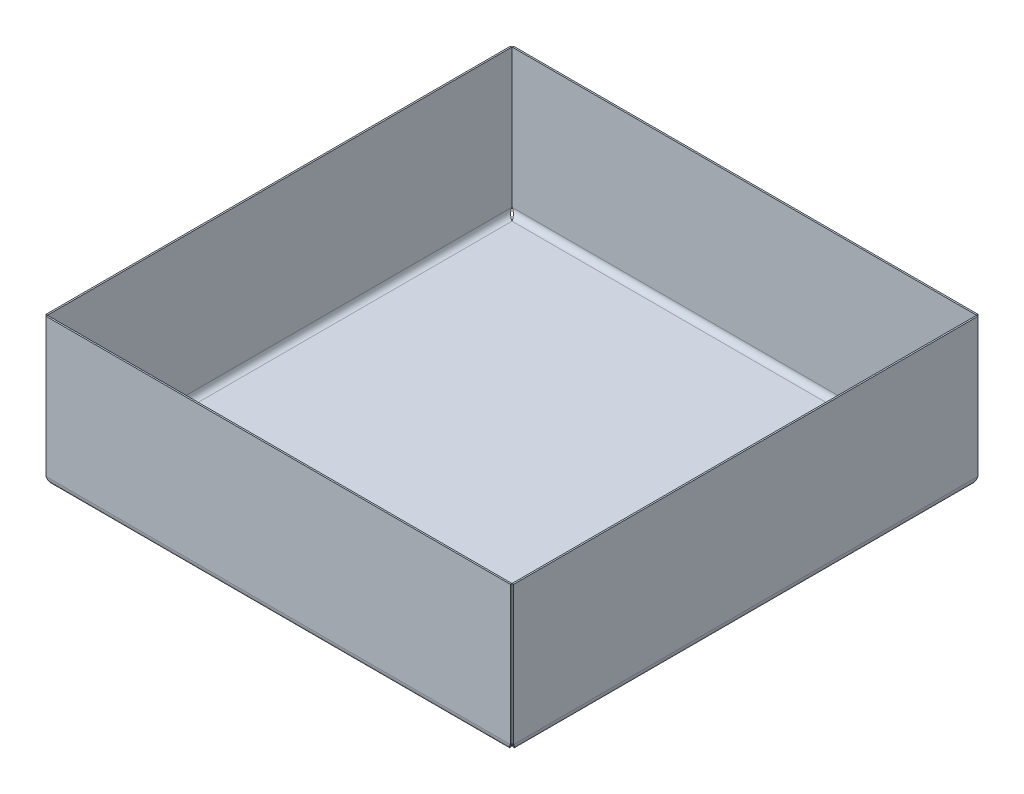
ISO-10303-21;
HEADER;
FILE_DESCRIPTION(('STEP AP214'),'2;1');
FILE_NAME('part.step','',(''),(''),'','','');
FILE_SCHEMA(('AUTOMOTIVE_DESIGN { 1 0 10303 214 1 1 1 1 }'));
ENDSEC;
DATA;
#1=APPLICATION_CONTEXT('core data for automotive mechanical design processes');
#2=APPLICATION_PROTOCOL_DEFINITION('international standard','automotive_design',2000,#1);
#3=PRODUCT_CONTEXT('',#1,'mechanical');
#4=PRODUCT('Part','Part','',(#3));
#5=PRODUCT_RELATED_PRODUCT_CATEGORY('part','',(#4));
#6=PRODUCT_DEFINITION_FORMATION('','',#4);
#7=PRODUCT_DEFINITION_CONTEXT('part definition',#1,'design');
#8=PRODUCT_DEFINITION('design','',#6,#7);
#9=PRODUCT_DEFINITION_SHAPE('','',#8);
#10=(LENGTH_UNIT() NAMED_UNIT(*) SI_UNIT(.MILLI.,.METRE.));
#11=(NAMED_UNIT(*) PLANE_ANGLE_UNIT() SI_UNIT($,.RADIAN.));
#12=(NAMED_UNIT(*) SI_UNIT($,.STERADIAN.) SOLID_ANGLE_UNIT());
#13=UNCERTAINTY_MEASURE_WITH_UNIT(LENGTH_MEASURE(1.E-05),#10,'distance_accuracy_value','');
#14=(GEOMETRIC_REPRESENTATION_CONTEXT(3) GLOBAL_UNCERTAINTY_ASSIGNED_CONTEXT((#13)) GLOBAL_UNIT_ASSIGNED_CONTEXT((#10,
#11,#12)) REPRESENTATION_CONTEXT('',''));
#15=CARTESIAN_POINT('',(0.,0.,0.));
#16=DIRECTION('',(0.,0.,1.));
#17=DIRECTION('',(1.,0.,0.));
#18=AXIS2_PLACEMENT_3D('',#15,#16,#17);
#19=CARTESIAN_POINT('',(7.46379303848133E-10,0.499999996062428,-150.000000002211));
#20=DIRECTION('',(0.,-1.,0.));
#21=DIRECTION('',(0.,0.,-1.));
#22=AXIS2_PLACEMENT_3D('',#19,#20,#21);
#23=PLANE('',#22);
#24=DIRECTION('',(0.,0.,1.));
#25=VECTOR('',#24,1.);
#26=CARTESIAN_POINT('',(7.46379303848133E-10,0.499999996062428,-2.21095364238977E-09));
#27=LINE('',#26,#25);
#28=CARTESIAN_POINT('',(7.46379303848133E-10,0.499999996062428,-150.000000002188));
#29=VERTEX_POINT('',#28);
#30=CARTESIAN_POINT('',(7.46378936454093E-10,0.499999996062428,-2.21095364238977E-09));
#31=VERTEX_POINT('',#30);
#32=EDGE_CURVE('E831',#29,#31,#27,.T.);
#33=ORIENTED_EDGE('',*,*,#32,.T.);
#34=DIRECTION('',(1.,0.,0.));
#35=VECTOR('',#34,1.);
#36=CARTESIAN_POINT('',(7.46379303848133E-10,0.499999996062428,-2.21095364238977E-09));
#37=LINE('',#36,#35);
#38=CARTESIAN_POINT('',(150.000000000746,0.499999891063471,-2.21095364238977E-09));
#39=VERTEX_POINT('',#38);
#40=EDGE_CURVE('E966',#31,#39,#37,.T.);
#41=ORIENTED_EDGE('',*,*,#40,.T.);
#42=DIRECTION('',(0.,0.,-1.));
#43=VECTOR('',#42,1.);
#44=CARTESIAN_POINT('',(150.000000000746,0.499999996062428,-2.21095364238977E-09));
#45=LINE('',#44,#43);
#46=CARTESIAN_POINT('',(150.000000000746,0.499999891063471,-149.999999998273));
#47=VERTEX_POINT('',#46);
#48=EDGE_CURVE('E1249',#39,#47,#45,.T.);
#49=ORIENTED_EDGE('',*,*,#48,.T.);
#50=DIRECTION('',(-1.,0.,0.));
#51=VECTOR('',#50,1.);
#52=CARTESIAN_POINT('',(7.46379303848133E-10,0.499999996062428,-150.000000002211));
#53=LINE('',#52,#51);
#54=EDGE_CURVE('E967',#47,#29,#53,.T.);
#55=ORIENTED_EDGE('',*,*,#54,.T.);
#56=EDGE_LOOP('',(#33,#41,#49,#55));
#57=FACE_BOUND('',#56,.T.);
#58=ADVANCED_FACE('F195',(#57),#23,.F.);
#59=CARTESIAN_POINT('',(7.46379303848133E-10,-3.93757249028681E-09,-150.000000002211));
#60=DIRECTION('',(0.,-1.,0.));
#61=DIRECTION('',(0.,0.,-1.));
#62=AXIS2_PLACEMENT_3D('',#59,#60,#61);
#63=PLANE('',#62);
#64=DIRECTION('',(0.,0.,1.));
#65=VECTOR('',#64,1.);
#66=CARTESIAN_POINT('',(7.46379303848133E-10,-3.93757249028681E-09,-2.21095364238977E-09));
#67=LINE('',#66,#65);
#68=CARTESIAN_POINT('',(7.46375183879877E-10,0.,-150.));
#69=VERTEX_POINT('',#68);
#70=CARTESIAN_POINT('',(7.46366301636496E-10,-4.37622160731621E-10,-2.21095364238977E-09));
#71=VERTEX_POINT('',#70);
#72=EDGE_CURVE('E968',#69,#71,#67,.T.);
#73=ORIENTED_EDGE('',*,*,#72,.F.);
#74=DIRECTION('',(-1.,0.,0.));
#75=VECTOR('',#74,1.);
#76=CARTESIAN_POINT('',(7.46379303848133E-10,-3.93757249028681E-09,-150.000000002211));
#77=LINE('',#76,#75);
#78=CARTESIAN_POINT('',(150.000000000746,0.,-149.999999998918));
#79=VERTEX_POINT('',#78);
#80=EDGE_CURVE('E1240',#79,#69,#77,.T.);
#81=ORIENTED_EDGE('',*,*,#80,.F.);
#82=DIRECTION('',(0.,0.,-1.));
#83=VECTOR('',#82,1.);
#84=CARTESIAN_POINT('',(150.000000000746,-3.93757249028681E-09,-2.21095364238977E-09));
#85=LINE('',#84,#83);
#86=CARTESIAN_POINT('',(150.000000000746,-1.08936529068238E-07,-2.21095364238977E-09));
#87=VERTEX_POINT('',#86);
#88=EDGE_CURVE('E206',#87,#79,#85,.T.);
#89=ORIENTED_EDGE('',*,*,#88,.F.);
#90=DIRECTION('',(1.,0.,0.));
#91=VECTOR('',#90,1.);
#92=CARTESIAN_POINT('',(7.46379303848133E-10,-3.93757249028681E-09,-2.21095364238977E-09));
#93=LINE('',#92,#91);
#94=EDGE_CURVE('E222',#71,#87,#93,.T.);
#95=ORIENTED_EDGE('',*,*,#94,.F.);
#96=EDGE_LOOP('',(#73,#81,#89,#95));
#97=FACE_BOUND('',#96,.T.);
#98=ADVANCED_FACE('F197',(#97),#63,.T.);
#99=CARTESIAN_POINT('',(151.950000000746,2.49999999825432,2.50504999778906));
#100=CARTESIAN_POINT('',(151.787476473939,2.17204225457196,2.50504999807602));
#101=CARTESIAN_POINT('',(151.625000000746,1.8443084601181,2.43985025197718));
#102=CARTESIAN_POINT('',(151.300000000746,1.23840927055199,2.18887859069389));
#103=CARTESIAN_POINT('',(151.137500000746,0.960529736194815,2.00320542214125));
#104=CARTESIAN_POINT('',(150.812500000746,0.496794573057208,1.53947025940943));
#105=CARTESIAN_POINT('',(150.650000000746,0.311121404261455,1.2615907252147));
#106=CARTESIAN_POINT('',(150.325000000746,0.0601497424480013,0.655691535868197));
#107=CARTESIAN_POINT('',(150.162523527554,-0.00505000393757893,0.327957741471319));
#108=CARTESIAN_POINT('',(150.000000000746,-0.00505000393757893,-2.21095364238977E-09));
#109=CARTESIAN_POINT('',(151.950000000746,2.4999999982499,2.49999999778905));
#110=CARTESIAN_POINT('',(151.787476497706,2.17270343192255,2.49999999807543));
#111=CARTESIAN_POINT('',(151.625000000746,1.84563028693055,2.43493168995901));
#112=CARTESIAN_POINT('',(151.300000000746,1.2409525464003,2.18446596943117));
#113=CARTESIAN_POINT('',(151.137500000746,0.963633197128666,1.99916710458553));
#114=CARTESIAN_POINT('',(150.812500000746,0.500832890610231,1.53636679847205));
#115=CARTESIAN_POINT('',(150.650000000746,0.315534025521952,1.25904744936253));
#116=CARTESIAN_POINT('',(150.325000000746,0.065068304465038,0.654369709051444));
#117=CARTESIAN_POINT('',(150.162523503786,-3.93757249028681E-09,0.327296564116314));
#118=CARTESIAN_POINT('',(150.000000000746,-3.93757249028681E-09,-2.21095364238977E-09));
#119=CARTESIAN_POINT('',(151.950000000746,2.49999999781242,1.99999999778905));
#120=CARTESIAN_POINT('',(151.787478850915,2.2381665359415,1.99999999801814));
#121=CARTESIAN_POINT('',(151.625000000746,1.97650422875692,1.94794535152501));
#122=CARTESIAN_POINT('',(151.300000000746,1.49276203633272,1.74757277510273));
#123=CARTESIAN_POINT('',(151.137500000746,1.27090655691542,1.59933368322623));
#124=CARTESIAN_POINT('',(150.812500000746,0.900666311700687,1.22909343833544));
#125=CARTESIAN_POINT('',(150.650000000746,0.752427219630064,1.00723795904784));
#126=CARTESIAN_POINT('',(150.325000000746,0.552054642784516,0.52349576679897));
#127=CARTESIAN_POINT('',(150.162521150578,0.499999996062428,0.26183345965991));
#128=CARTESIAN_POINT('',(150.000000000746,0.499999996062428,-2.21095364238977E-09));
#129=CARTESIAN_POINT('',(151.950000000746,2.49999999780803,1.99499999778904));
#130=CARTESIAN_POINT('',(151.787478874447,2.23882116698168,1.99499999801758));
#131=CARTESIAN_POINT('',(151.625000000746,1.97781296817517,1.94307548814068));
#132=CARTESIAN_POINT('',(151.300000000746,1.49528013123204,1.74320384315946));
#133=CARTESIAN_POINT('',(151.137500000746,1.27397929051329,1.59533534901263));
#134=CARTESIAN_POINT('',(150.812500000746,0.904664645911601,1.22602070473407));
#135=CARTESIAN_POINT('',(150.650000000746,0.756796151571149,1.00471986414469));
#136=CARTESIAN_POINT('',(150.325000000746,0.556924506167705,0.522187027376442));
#137=CARTESIAN_POINT('',(150.162521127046,0.504999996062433,0.261178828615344));
#138=CARTESIAN_POINT('',(150.000000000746,0.504999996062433,-2.21095364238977E-09));
#139=B_SPLINE_SURFACE_WITH_KNOTS('',1,3,((#99,#100,#101,#102,#103,#104,#105,#106,#107,#108),
(#109,#110,#111,#112,#113,#114,#115,#116,#117,#118),(#119,#120,#121,#122,#123,#124,#125,#126,
#127,#128),(#129,#130,#131,#132,#133,#134,#135,#136,#137,#138)),.UNSPECIFIED.,.F.,.F.,.F.,(2,1,
1,2),(4,2,2,2,4),(-0.0101,0.,1.,1.01),(0.,0.25,0.5,0.75,1.),.UNSPECIFIED.);
#140=CARTESIAN_POINT('',(151.950000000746,2.49999999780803,1.99499999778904));
#141=CARTESIAN_POINT('',(151.950000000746,2.49999999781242,1.99999999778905));
#142=CARTESIAN_POINT('',(151.950000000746,2.4999999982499,2.49999999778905));
#143=CARTESIAN_POINT('',(151.950000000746,2.49999999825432,2.50504999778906));
#144=B_SPLINE_CURVE_WITH_KNOTS('',1,(#140,#141,#142,#143),.UNSPECIFIED.,.F.,.F.,(2,1,1,2),
(-0.0101,-9.9999999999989E-05,0.9999,1.01),.UNSPECIFIED.);
#145=CARTESIAN_POINT('',(151.950000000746,2.49999999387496,2.49999999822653));
#146=VERTEX_POINT('',#145);
#147=CARTESIAN_POINT('',(151.950000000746,2.49999999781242,1.99999999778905));
#148=VERTEX_POINT('',#147);
#149=EDGE_CURVE('E700',#146,#148,#144,.F.);
#150=CARTESIAN_POINT('',(151.949999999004,2.49999999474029,2.49999999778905));
#151=CARTESIAN_POINT('',(151.911521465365,2.42251431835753,2.50001013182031));
#152=CARTESIAN_POINT('',(151.873045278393,2.34503203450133,2.49639768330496));
#153=CARTESIAN_POINT('',(151.796096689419,2.19073954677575,2.48200486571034));
#154=CARTESIAN_POINT('',(151.757624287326,2.11392930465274,2.47122490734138));
#155=CARTESIAN_POINT('',(151.680709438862,1.96169948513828,2.44258602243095));
#156=CARTESIAN_POINT('',(151.642266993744,1.88627882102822,2.42473289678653));
#157=CARTESIAN_POINT('',(151.565389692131,1.73743836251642,2.38212112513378));
#158=CARTESIAN_POINT('',(151.526954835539,1.66401854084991,2.35736257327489));
#159=CARTESIAN_POINT('',(151.411615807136,1.44762409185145,2.27297676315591));
#160=CARTESIAN_POINT('',(151.334654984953,1.30846981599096,2.20323088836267));
#161=CARTESIAN_POINT('',(151.180800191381,1.04556482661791,2.03927630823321));
#162=CARTESIAN_POINT('',(151.103906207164,0.921809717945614,1.94507460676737));
#163=CARTESIAN_POINT('',(150.949038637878,0.692242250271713,1.73396876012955));
#164=CARTESIAN_POINT('',(150.871064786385,0.586700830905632,1.61676948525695));
#165=CARTESIAN_POINT('',(150.715072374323,0.399382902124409,1.36458528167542));
#166=CARTESIAN_POINT('',(150.637053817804,0.317621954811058,1.22958878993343));
#167=CARTESIAN_POINT('',(150.480969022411,0.180800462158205,0.946600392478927));
#168=CARTESIAN_POINT('',(150.402902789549,0.125759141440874,0.798599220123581));
#169=CARTESIAN_POINT('',(150.246873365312,0.0444981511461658,0.49507219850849));
#170=CARTESIAN_POINT('',(150.168910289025,0.0182198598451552,0.339562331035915));
#171=CARTESIAN_POINT('',(150.075875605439,0.00447967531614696,0.152714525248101));
#172=CARTESIAN_POINT('',(150.060690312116,0.00279912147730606,0.122176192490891));
#173=CARTESIAN_POINT('',(150.030338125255,0.000560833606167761,0.061095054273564));
#174=CARTESIAN_POINT('',(150.015171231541,1.75237053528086E-06,0.0305522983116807));
#175=CARTESIAN_POINT('',(150.000000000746,-3.93757249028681E-09,-2.21095364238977E-09));
#176=B_SPLINE_CURVE_WITH_KNOTS('',3,(#150,#151,#152,#153,#154,#155,#156,#157,#158,#159,#160,
#161,#162,#163,#164,#165,#166,#167,#168,#169,#170,#171,#172,#173,#174,#175),.UNSPECIFIED.,.F.,
.F.,(4,2,2,2,2,2,2,2,2,2,2,2,4),(0.,0.259458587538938,0.518902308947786,0.778133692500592,
1.03736154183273,1.55566734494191,2.07382487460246,2.59912719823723,3.12477251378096,
3.65079546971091,4.17574433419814,4.27817706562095,4.38048667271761),.UNSPECIFIED.);
#177=EDGE_CURVE('E747',#146,#87,#176,.T.);
#178=CARTESIAN_POINT('',(150.000000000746,-0.00505000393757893,-2.21095364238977E-09));
#179=CARTESIAN_POINT('',(150.000000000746,-3.93757249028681E-09,-2.21095364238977E-09));
#180=CARTESIAN_POINT('',(150.000000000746,0.499999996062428,-2.21095364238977E-09));
#181=CARTESIAN_POINT('',(150.000000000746,0.504999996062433,-2.21095364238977E-09));
#182=B_SPLINE_CURVE_WITH_KNOTS('',1,(#178,#179,#180,#181),.UNSPECIFIED.,.F.,.F.,(2,1,1,2),
(-0.0101,0.,1.,1.01),.UNSPECIFIED.);
#183=EDGE_CURVE('E494',#87,#39,#182,.T.);
#184=CARTESIAN_POINT('',(151.950000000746,2.49999999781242,1.99999999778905));
#185=CARTESIAN_POINT('',(151.908891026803,2.43377437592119,2.00001069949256));
#186=CARTESIAN_POINT('',(151.86778499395,2.36755158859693,1.99671077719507));
#187=CARTESIAN_POINT('',(151.785577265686,2.2357611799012,1.98357052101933));
#188=CARTESIAN_POINT('',(151.744475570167,2.17019351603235,1.97373061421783));
#189=CARTESIAN_POINT('',(151.662294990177,2.04039412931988,1.94759927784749));
#190=CARTESIAN_POINT('',(151.621216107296,1.97616160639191,1.93131183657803));
#191=CARTESIAN_POINT('',(151.539067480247,1.849643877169,1.89246472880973));
#192=CARTESIAN_POINT('',(151.497997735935,1.78735863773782,1.86990516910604));
#193=CARTESIAN_POINT('',(151.374752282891,1.60427086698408,1.79308257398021));
#194=CARTESIAN_POINT('',(151.292515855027,1.48719684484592,1.72966761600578));
#195=CARTESIAN_POINT('',(151.128124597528,1.26798816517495,1.58104313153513));
#196=CARTESIAN_POINT('',(151.04596974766,1.16584598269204,1.49584464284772));
#197=CARTESIAN_POINT('',(150.881584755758,0.980273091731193,1.30689753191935));
#198=CARTESIAN_POINT('',(150.799354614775,0.896859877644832,1.20313172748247));
#199=CARTESIAN_POINT('',(150.634813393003,0.752118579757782,0.981051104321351));
#200=CARTESIAN_POINT('',(150.552502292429,0.69080049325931,0.862729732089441));
#201=CARTESIAN_POINT('',(150.431077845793,0.618441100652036,0.680987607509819));
#202=CARTESIAN_POINT('',(150.391898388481,0.597881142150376,0.621237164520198));
#203=CARTESIAN_POINT('',(150.313532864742,0.562493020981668,0.500044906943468));
#204=CARTESIAN_POINT('',(150.274346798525,0.547664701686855,0.438603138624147));
#205=CARTESIAN_POINT('',(150.195970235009,0.523887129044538,0.314586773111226));
#206=CARTESIAN_POINT('',(150.156779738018,0.514938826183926,0.252011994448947));
#207=CARTESIAN_POINT('',(150.078393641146,0.502990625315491,0.12629239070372));
#208=CARTESIAN_POINT('',(150.039198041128,0.499991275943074,0.0631475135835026));
#209=CARTESIAN_POINT('',(150.000000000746,0.499999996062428,-2.21095364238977E-09));
#210=B_SPLINE_CURVE_WITH_KNOTS('',3,(#184,#185,#186,#187,#188,#189,#190,#191,#192,#193,#194,
#195,#196,#197,#198,#199,#200,#201,#202,#203,#204,#205,#206,#207,#208,#209),.UNSPECIFIED.,.F.,
.F.,(4,2,2,2,2,2,2,2,2,2,2,2,4),(0.,0.233765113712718,0.467514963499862,0.701120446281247,
0.934721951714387,1.40178540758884,1.8686126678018,2.33587418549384,2.8033468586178,
3.02620235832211,3.24905176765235,3.47193719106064,3.69484316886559),.UNSPECIFIED.);
#211=EDGE_CURVE('E746',#148,#39,#210,.T.);
#212=ORIENTED_EDGE('',*,*,#149,.F.);
#213=ORIENTED_EDGE('',*,*,#177,.T.);
#214=ORIENTED_EDGE('',*,*,#183,.T.);
#215=ORIENTED_EDGE('',*,*,#211,.F.);
#216=EDGE_LOOP('',(#212,#213,#214,#215));
#217=FACE_BOUND('',#216,.T.);
#218=ADVANCED_FACE('F727',(#217),#139,.F.);
#219=CARTESIAN_POINT('',(7.46375834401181E-10,-0.00500000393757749,-2.21095364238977E-09));
#220=CARTESIAN_POINT('',(-0.162523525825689,-0.00500000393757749,0.327951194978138));
#221=CARTESIAN_POINT('',(-0.324999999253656,0.0601984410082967,0.655678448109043));
#222=CARTESIAN_POINT('',(-0.649999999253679,0.311165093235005,1.26156554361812));
#223=CARTESIAN_POINT('',(-0.812499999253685,0.496834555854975,1.53943953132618));
#224=CARTESIAN_POINT('',(-1.13749999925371,0.960560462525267,2.00316543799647));
#225=CARTESIAN_POINT('',(-1.29999999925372,1.23843445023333,2.18883490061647));
#226=CARTESIAN_POINT('',(-1.62499999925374,1.84432154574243,2.43980155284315));
#227=CARTESIAN_POINT('',(-1.78747647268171,2.17204879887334,2.50499999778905));
#228=CARTESIAN_POINT('',(-1.94999999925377,2.49999999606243,2.50499999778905));
#229=CARTESIAN_POINT('',(7.46375834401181E-10,-3.93757249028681E-09,-2.21095364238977E-09));
#230=CARTESIAN_POINT('',(-0.162523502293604,-3.93757249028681E-09,0.327296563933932));
#231=CARTESIAN_POINT('',(-0.324999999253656,0.0650683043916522,0.654369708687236));
#232=CARTESIAN_POINT('',(-0.649999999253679,0.315534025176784,1.25904744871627));
#233=CARTESIAN_POINT('',(-0.812499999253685,0.500832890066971,1.53636679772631));
#234=CARTESIAN_POINT('',(-1.13749999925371,0.963633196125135,1.99916710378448));
#235=CARTESIAN_POINT('',(-1.29999999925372,1.24095254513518,2.18446596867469));
#236=CARTESIAN_POINT('',(-1.62499999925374,1.84563028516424,2.43493168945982));
#237=CARTESIAN_POINT('',(-1.78747649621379,2.17270342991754,2.49999999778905));
#238=CARTESIAN_POINT('',(-1.94999999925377,2.49999999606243,2.49999999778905));
#239=CARTESIAN_POINT('',(7.46375834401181E-10,0.499999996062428,-2.21095364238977E-09));
#240=CARTESIAN_POINT('',(-0.162521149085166,0.499999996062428,0.261833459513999));
#241=CARTESIAN_POINT('',(-0.324999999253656,0.552054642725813,0.523495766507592));
#242=CARTESIAN_POINT('',(-0.649999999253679,0.752427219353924,1.00723795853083));
#243=CARTESIAN_POINT('',(-0.812499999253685,0.900666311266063,1.22909343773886));
#244=CARTESIAN_POINT('',(-1.13749999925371,1.27090655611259,1.59933368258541));
#245=CARTESIAN_POINT('',(-1.29999999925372,1.49276203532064,1.74757277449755));
#246=CARTESIAN_POINT('',(-1.62499999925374,1.97650422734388,1.94794535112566));
#247=CARTESIAN_POINT('',(-1.78747884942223,2.23816653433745,1.99999999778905));
#248=CARTESIAN_POINT('',(-1.94999999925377,2.49999999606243,1.99999999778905));
#249=CARTESIAN_POINT('',(7.46375834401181E-10,0.505049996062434,-2.21095364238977E-09));
#250=CARTESIAN_POINT('',(-0.162521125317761,0.505049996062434,0.261172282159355));
#251=CARTESIAN_POINT('',(-0.324999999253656,0.556973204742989,0.522173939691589));
#252=CARTESIAN_POINT('',(-0.649999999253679,0.756839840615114,1.00469468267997));
#253=CARTESIAN_POINT('',(-0.812499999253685,0.904704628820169,1.22598997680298));
#254=CARTESIAN_POINT('',(-1.13749999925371,1.27401001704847,1.59529536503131));
#255=CARTESIAN_POINT('',(-1.29999999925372,1.49530531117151,1.74316015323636));
#256=CARTESIAN_POINT('',(-1.62499999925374,1.97782605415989,1.94302678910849));
#257=CARTESIAN_POINT('',(-1.78747887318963,2.23882771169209,1.99494999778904));
#258=CARTESIAN_POINT('',(-1.94999999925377,2.49999999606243,1.99494999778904));
#259=B_SPLINE_SURFACE_WITH_KNOTS('',1,3,((#219,#220,#221,#222,#223,#224,#225,#226,#227,#228),
(#229,#230,#231,#232,#233,#234,#235,#236,#237,#238),(#239,#240,#241,#242,#243,#244,#245,#246,
#247,#248),(#249,#250,#251,#252,#253,#254,#255,#256,#257,#258)),.UNSPECIFIED.,.F.,.F.,.F.,(2,1,
1,2),(4,2,2,2,4),(-0.01,0.,1.,1.0101),(0.,0.25,0.5,0.75,1.),.UNSPECIFIED.);
#260=CARTESIAN_POINT('',(7.46375834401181E-10,-3.93757249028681E-09,-2.21095364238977E-09));
#261=CARTESIAN_POINT('',(-0.0380829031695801,-9.72119728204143E-06,0.0766890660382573));
#262=CARTESIAN_POINT('',(-0.0761635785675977,0.00352862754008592,0.153374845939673));
#263=CARTESIAN_POINT('',(-0.152321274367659,0.0176273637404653,0.30609486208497));
#264=CARTESIAN_POINT('',(-0.190398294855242,0.0281873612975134,0.382129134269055));
#265=CARTESIAN_POINT('',(-0.266522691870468,0.0562438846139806,0.532848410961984));
#266=CARTESIAN_POINT('',(-0.304570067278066,0.0737347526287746,0.607534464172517));
#267=CARTESIAN_POINT('',(-0.380657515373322,0.11548652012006,0.754966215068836));
#268=CARTESIAN_POINT('',(-0.418697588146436,0.13974733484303,0.827711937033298));
#269=CARTESIAN_POINT('',(-0.532850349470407,0.222445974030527,1.04219830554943));
#270=CARTESIAN_POINT('',(-0.609018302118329,0.290808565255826,1.18023388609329));
#271=CARTESIAN_POINT('',(-0.761290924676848,0.451582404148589,1.44136207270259));
#272=CARTESIAN_POINT('',(-0.83739560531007,0.543987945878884,1.5644582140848));
#273=CARTESIAN_POINT('',(-0.991473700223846,0.752266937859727,1.7944530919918));
#274=CARTESIAN_POINT('',(-1.0694476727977,0.868655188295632,1.90088660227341));
#275=CARTESIAN_POINT('',(-1.22543801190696,1.11939659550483,2.09012429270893));
#276=CARTESIAN_POINT('',(-1.3034543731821,1.25376134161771,2.17291312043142));
#277=CARTESIAN_POINT('',(-1.45953459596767,1.53568730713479,2.31189041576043));
#278=CARTESIAN_POINT('',(-1.53759845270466,1.68325765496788,2.3680603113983));
#279=CARTESIAN_POINT('',(-1.69362699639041,1.98615156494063,2.45164179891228));
#280=CARTESIAN_POINT('',(-1.77159157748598,2.14145935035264,2.47910958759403));
#281=CARTESIAN_POINT('',(-1.86621551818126,2.3313872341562,2.49453801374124));
#282=CARTESIAN_POINT('',(-1.8829843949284,2.36510035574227,2.49658711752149));
#283=CARTESIAN_POINT('',(-1.91650044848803,2.43253860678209,2.49931620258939));
#284=CARTESIAN_POINT('',(-1.93324762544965,2.46626366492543,2.4999979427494));
#285=CARTESIAN_POINT('',(-1.94999999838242,2.49999999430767,2.49999999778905));
#286=B_SPLINE_CURVE_WITH_KNOTS('',3,(#260,#261,#262,#263,#264,#265,#266,#267,#268,#269,#270,
#271,#272,#273,#274,#275,#276,#277,#278,#279,#280,#281,#282,#283,#284,#285),.UNSPECIFIED.,.F.,
.F.,(4,2,2,2,2,2,2,2,2,2,2,2,4),(0.,0.256792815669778,0.513571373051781,0.770140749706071,
1.02670691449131,1.53968577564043,2.05254300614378,2.57783820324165,3.10347370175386,
3.62947539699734,4.15444527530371,4.2675600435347,4.38052921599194),.UNSPECIFIED.);
#287=CARTESIAN_POINT('',(-1.94999999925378,2.49999999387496,2.49999999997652));
#288=VERTEX_POINT('',#287);
#289=EDGE_CURVE('E789',#71,#288,#286,.T.);
#290=CARTESIAN_POINT('',(-1.94999999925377,2.49999999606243,2.50499999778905));
#291=CARTESIAN_POINT('',(-1.94999999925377,2.49999999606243,2.49999999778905));
#292=CARTESIAN_POINT('',(-1.94999999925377,2.49999999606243,1.99999999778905));
#293=CARTESIAN_POINT('',(-1.94999999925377,2.49999999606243,1.99494999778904));
#294=B_SPLINE_CURVE_WITH_KNOTS('',1,(#290,#291,#292,#293),.UNSPECIFIED.,.F.,.F.,(2,1,1,2),
(-0.01,0.,1.,1.0101),.UNSPECIFIED.);
#295=CARTESIAN_POINT('',(-1.94999999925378,2.49999999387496,1.99999999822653));
#296=VERTEX_POINT('',#295);
#297=EDGE_CURVE('E802',#296,#288,#294,.F.);
#298=CARTESIAN_POINT('',(7.46375834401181E-10,0.499999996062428,-2.21095364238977E-09));
#299=CARTESIAN_POINT('',(-0.0411092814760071,0.499989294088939,0.0662261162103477));
#300=CARTESIAN_POINT('',(-0.0822156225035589,0.503289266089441,0.132449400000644));
#301=CARTESIAN_POINT('',(-0.164423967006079,0.516429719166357,0.264240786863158));
#302=CARTESIAN_POINT('',(-0.20552597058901,0.526269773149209,0.329808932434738));
#303=CARTESIAN_POINT('',(-0.287707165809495,0.552401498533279,0.459609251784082));
#304=CARTESIAN_POINT('',(-0.32878635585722,0.568689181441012,0.523842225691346));
#305=CARTESIAN_POINT('',(-0.410935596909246,0.607536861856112,0.650360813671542));
#306=CARTESIAN_POINT('',(-0.452005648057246,0.630096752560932,0.712646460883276));
#307=CARTESIAN_POINT('',(-0.57525202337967,0.706920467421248,0.895735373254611));
#308=CARTESIAN_POINT('',(-0.657489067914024,0.770336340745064,1.01281004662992));
#309=CARTESIAN_POINT('',(-0.821881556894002,0.918962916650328,1.2320197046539));
#310=CARTESIAN_POINT('',(-0.904037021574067,1.00416258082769,1.33416221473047));
#311=CARTESIAN_POINT('',(-1.06842263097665,1.1931115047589,1.51973467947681));
#312=CARTESIAN_POINT('',(-1.15065277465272,1.29687780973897,1.60314727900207));
#313=CARTESIAN_POINT('',(-1.31519399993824,1.51895929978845,1.74788725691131));
#314=CARTESIAN_POINT('',(-1.3975051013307,1.63728103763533,1.80920463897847));
#315=CARTESIAN_POINT('',(-1.51892893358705,1.8190226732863,1.88156258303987));
#316=CARTESIAN_POINT('',(-1.55810777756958,1.87877228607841,1.90212190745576));
#317=CARTESIAN_POINT('',(-1.63647207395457,1.99996280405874,1.93750893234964));
#318=CARTESIAN_POINT('',(-1.67565752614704,2.06140366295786,1.9523367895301));
#319=CARTESIAN_POINT('',(-1.75403285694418,2.18541814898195,1.97611361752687));
#320=CARTESIAN_POINT('',(-1.79322273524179,2.24799195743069,1.98506163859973));
#321=CARTESIAN_POINT('',(-1.87160759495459,2.37370959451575,1.99700946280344));
#322=CARTESIAN_POINT('',(-1.91080257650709,2.43685347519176,2.00000871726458));
#323=CARTESIAN_POINT('',(-1.94999999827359,2.49999999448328,1.99999999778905));
#324=B_SPLINE_CURVE_WITH_KNOTS('',3,(#298,#299,#300,#301,#302,#303,#304,#305,#306,#307,#308,
#309,#310,#311,#312,#313,#314,#315,#316,#317,#318,#319,#320,#321,#322,#323),.UNSPECIFIED.,.F.,
.F.,(4,2,2,2,2,2,2,2,2,2,2,2,4),(0.,0.2337668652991,0.46751846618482,0.701125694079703,
0.934728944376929,1.40179589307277,1.8686266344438,2.33588817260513,2.80336084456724,
3.0262128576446,3.24905877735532,3.471940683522,3.69484314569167),.UNSPECIFIED.);
#325=EDGE_CURVE('E1461',#31,#296,#324,.T.);
#326=CARTESIAN_POINT('',(7.46378844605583E-10,-3.93757249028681E-09,-2.21095364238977E-09));
#327=CARTESIAN_POINT('',(7.46378936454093E-10,0.499999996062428,-2.21095364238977E-09));
#328=B_SPLINE_CURVE_WITH_KNOTS('',1,(#326,#327),.UNSPECIFIED.,.F.,.F.,(2,2),(0.,1.),.UNSPECIFIED.);
#329=EDGE_CURVE('E875',#71,#31,#328,.T.);
#330=ORIENTED_EDGE('',*,*,#289,.T.);
#331=ORIENTED_EDGE('',*,*,#297,.F.);
#332=ORIENTED_EDGE('',*,*,#325,.F.);
#333=ORIENTED_EDGE('',*,*,#329,.F.);
#334=EDGE_LOOP('',(#330,#331,#332,#333));
#335=FACE_BOUND('',#334,.T.);
#336=ADVANCED_FACE('F725',(#335),#259,.F.);
#337=CARTESIAN_POINT('',(-78.9509053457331,2.49999999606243,-2.21095364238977E-09));
#338=DIRECTION('',(1.,0.,0.));
#339=DIRECTION('',(0.,0.,-1.));
#340=AXIS2_PLACEMENT_3D('',#337,#338,#339);
#341=CYLINDRICAL_SURFACE('',#340,2.);
#342=ORIENTED_EDGE('',*,*,#40,.F.);
#343=ORIENTED_EDGE('',*,*,#325,.T.);
#344=DIRECTION('',(1.,0.,0.));
#345=VECTOR('',#344,1.);
#346=CARTESIAN_POINT('',(7.46379303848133E-10,2.49999999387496,1.99999999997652));
#347=LINE('',#346,#345);
#348=EDGE_CURVE('E811',#296,#148,#347,.T.);
#349=ORIENTED_EDGE('',*,*,#348,.T.);
#350=ORIENTED_EDGE('',*,*,#211,.T.);
#351=EDGE_LOOP('',(#342,#343,#349,#350));
#352=FACE_BOUND('',#351,.T.);
#353=ADVANCED_FACE('F720',(#352),#341,.F.);
#354=CARTESIAN_POINT('',(-78.9509053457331,2.49999999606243,-2.21095364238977E-09));
#355=DIRECTION('',(1.,0.,0.));
#356=DIRECTION('',(0.,0.,-1.));
#357=AXIS2_PLACEMENT_3D('',#354,#355,#356);
#358=CYLINDRICAL_SURFACE('',#357,2.5);
#359=ORIENTED_EDGE('',*,*,#94,.T.);
#360=ORIENTED_EDGE('',*,*,#177,.F.);
#361=DIRECTION('',(-1.,0.,0.));
#362=VECTOR('',#361,1.);
#363=CARTESIAN_POINT('',(7.46379303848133E-10,2.49999999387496,2.49999999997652));
#364=LINE('',#363,#362);
#365=EDGE_CURVE('E787',#146,#288,#364,.T.);
#366=ORIENTED_EDGE('',*,*,#365,.T.);
#367=ORIENTED_EDGE('',*,*,#289,.F.);
#368=EDGE_LOOP('',(#359,#360,#366,#367));
#369=FACE_BOUND('',#368,.T.);
#370=ADVANCED_FACE('F724',(#369),#358,.T.);
#371=CARTESIAN_POINT('',(7.46379303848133E-10,48.499999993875,2.49999999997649));
#372=DIRECTION('',(0.,-1.,0.));
#373=DIRECTION('',(0.,0.,-1.));
#374=AXIS2_PLACEMENT_3D('',#371,#372,#373);
#375=PLANE('',#374);
#376=DIRECTION('',(1.,0.,0.));
#377=VECTOR('',#376,1.);
#378=CARTESIAN_POINT('',(7.46379303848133E-10,48.499999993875,1.99999999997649));
#379=LINE('',#378,#377);
#380=CARTESIAN_POINT('',(151.950000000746,48.499999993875,1.99999999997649));
#381=VERTEX_POINT('',#380);
#382=CARTESIAN_POINT('',(-1.94999999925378,48.499999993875,1.99999999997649));
#383=VERTEX_POINT('',#382);
#384=EDGE_CURVE('E799',#381,#383,#379,.F.);
#385=ORIENTED_EDGE('',*,*,#384,.T.);
#386=DIRECTION('',(0.,0.,-1.));
#387=VECTOR('',#386,1.);
#388=CARTESIAN_POINT('',(-1.94999999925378,48.499999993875,2.49999999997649));
#389=LINE('',#388,#387);
#390=CARTESIAN_POINT('',(-1.94999999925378,48.499999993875,2.49999999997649));
#391=VERTEX_POINT('',#390);
#392=EDGE_CURVE('E805',#391,#383,#389,.T.);
#393=ORIENTED_EDGE('',*,*,#392,.F.);
#394=DIRECTION('',(-1.,0.,0.));
#395=VECTOR('',#394,1.);
#396=CARTESIAN_POINT('',(7.46379303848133E-10,48.499999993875,2.49999999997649));
#397=LINE('',#396,#395);
#398=CARTESIAN_POINT('',(151.950000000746,48.499999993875,2.49999999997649));
#399=VERTEX_POINT('',#398);
#400=EDGE_CURVE('E801',#399,#391,#397,.T.);
#401=ORIENTED_EDGE('',*,*,#400,.F.);
#402=DIRECTION('',(0.,0.,-1.));
#403=VECTOR('',#402,1.);
#404=CARTESIAN_POINT('',(151.950000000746,48.499999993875,2.49999999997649));
#405=LINE('',#404,#403);
#406=EDGE_CURVE('E793',#399,#381,#405,.T.);
#407=ORIENTED_EDGE('',*,*,#406,.T.);
#408=EDGE_LOOP('',(#385,#393,#401,#407));
#409=FACE_BOUND('',#408,.T.);
#410=ADVANCED_FACE('F671',(#409),#375,.F.);
#411=CARTESIAN_POINT('',(7.46379303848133E-10,48.499999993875,1.99999999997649));
#412=DIRECTION('',(0.,0.,-1.));
#413=DIRECTION('',(-1.,0.,0.));
#414=AXIS2_PLACEMENT_3D('',#411,#412,#413);
#415=PLANE('',#414);
#416=ORIENTED_EDGE('',*,*,#384,.F.);
#417=DIRECTION('',(0.,-1.,0.));
#418=VECTOR('',#417,1.);
#419=CARTESIAN_POINT('',(151.950000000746,48.499999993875,1.99999999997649));
#420=LINE('',#419,#418);
#421=EDGE_CURVE('E706',#148,#381,#420,.F.);
#422=ORIENTED_EDGE('',*,*,#421,.F.);
#423=ORIENTED_EDGE('',*,*,#348,.F.);
#424=DIRECTION('',(0.,1.,0.));
#425=VECTOR('',#424,1.);
#426=CARTESIAN_POINT('',(-1.94999999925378,0.499999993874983,1.99999999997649));
#427=LINE('',#426,#425);
#428=EDGE_CURVE('E1475',#383,#296,#427,.F.);
#429=ORIENTED_EDGE('',*,*,#428,.F.);
#430=EDGE_LOOP('',(#416,#422,#423,#429));
#431=FACE_BOUND('',#430,.T.);
#432=ADVANCED_FACE('F1372',(#431),#415,.T.);
#433=CARTESIAN_POINT('',(-1.94999999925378,0.499999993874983,2.49999999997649));
#434=DIRECTION('',(1.,0.,0.));
#435=DIRECTION('',(0.,0.,-1.));
#436=AXIS2_PLACEMENT_3D('',#433,#434,#435);
#437=PLANE('',#436);
#438=ORIENTED_EDGE('',*,*,#297,.T.);
#439=DIRECTION('',(0.,-1.,0.));
#440=VECTOR('',#439,1.);
#441=CARTESIAN_POINT('',(-1.94999999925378,48.499999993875,2.49999999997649));
#442=LINE('',#441,#440);
#443=EDGE_CURVE('E783',#391,#288,#442,.T.);
#444=ORIENTED_EDGE('',*,*,#443,.F.);
#445=ORIENTED_EDGE('',*,*,#392,.T.);
#446=ORIENTED_EDGE('',*,*,#428,.T.);
#447=EDGE_LOOP('',(#438,#444,#445,#446));
#448=FACE_BOUND('',#447,.T.);
#449=ADVANCED_FACE('F1365',(#448),#437,.F.);
#450=CARTESIAN_POINT('',(7.46379303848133E-10,48.499999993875,2.49999999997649));
#451=DIRECTION('',(0.,0.,-1.));
#452=DIRECTION('',(-1.,0.,0.));
#453=AXIS2_PLACEMENT_3D('',#450,#451,#452);
#454=PLANE('',#453);
#455=ORIENTED_EDGE('',*,*,#365,.F.);
#456=DIRECTION('',(0.,1.,0.));
#457=VECTOR('',#456,1.);
#458=CARTESIAN_POINT('',(151.950000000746,48.499999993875,2.49999999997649));
#459=LINE('',#458,#457);
#460=EDGE_CURVE('E1477',#146,#399,#459,.T.);
#461=ORIENTED_EDGE('',*,*,#460,.T.);
#462=ORIENTED_EDGE('',*,*,#400,.T.);
#463=ORIENTED_EDGE('',*,*,#443,.T.);
#464=EDGE_LOOP('',(#455,#461,#462,#463));
#465=FACE_BOUND('',#464,.T.);
#466=ADVANCED_FACE('F718',(#465),#454,.F.);
#467=CARTESIAN_POINT('',(151.950000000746,48.499999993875,2.49999999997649));
#468=DIRECTION('',(-1.,0.,0.));
#469=DIRECTION('',(0.,0.,1.));
#470=AXIS2_PLACEMENT_3D('',#467,#468,#469);
#471=PLANE('',#470);
#472=ORIENTED_EDGE('',*,*,#149,.T.);
#473=ORIENTED_EDGE('',*,*,#421,.T.);
#474=ORIENTED_EDGE('',*,*,#406,.F.);
#475=ORIENTED_EDGE('',*,*,#460,.F.);
#476=EDGE_LOOP('',(#472,#473,#474,#475));
#477=FACE_BOUND('',#476,.T.);
#478=ADVANCED_FACE('F708',(#477),#471,.F.);
#479=CARTESIAN_POINT('',(-2.49999999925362,2.50000000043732,1.94999999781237));
#480=CARTESIAN_POINT('',(-2.49999999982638,2.17270343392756,1.78747649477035));
#481=CARTESIAN_POINT('',(-2.43493169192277,1.84563028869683,1.62499999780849));
#482=CARTESIAN_POINT('',(-2.18446597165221,1.2409525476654,1.29999999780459));
#483=CARTESIAN_POINT('',(-1.99916710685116,0.963633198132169,1.13749999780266));
#484=CARTESIAN_POINT('',(-1.53636680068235,0.500832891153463,0.812499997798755));
#485=CARTESIAN_POINT('',(-1.25904745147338,0.31553402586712,0.64999999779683));
#486=CARTESIAN_POINT('',(-0.654369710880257,0.065068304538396,0.324999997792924));
#487=CARTESIAN_POINT('',(-0.327296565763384,-3.93757249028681E-09,0.162523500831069));
#488=CARTESIAN_POINT('',(7.46378844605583E-10,-3.93757249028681E-09,-2.21095364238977E-09));
#489=CARTESIAN_POINT('',(-1.99999999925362,2.49999999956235,1.94999999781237));
#490=CARTESIAN_POINT('',(-1.99999999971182,2.23816653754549,1.78747884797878));
#491=CARTESIAN_POINT('',(-1.94794535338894,1.97650423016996,1.62499999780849));
#492=CARTESIAN_POINT('',(-1.74757277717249,1.4927620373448,1.29999999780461));
#493=CARTESIAN_POINT('',(-1.59933368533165,1.27090655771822,1.13749999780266));
#494=CARTESIAN_POINT('',(-1.2290934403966,0.900666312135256,0.812499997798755));
#495=CARTESIAN_POINT('',(-1.00723796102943,0.752427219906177,0.64999999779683));
#496=CARTESIAN_POINT('',(-0.52349576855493,0.552054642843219,0.324999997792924));
#497=CARTESIAN_POINT('',(-0.261833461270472,0.499999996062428,0.162521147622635));
#498=CARTESIAN_POINT('',(7.46378936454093E-10,0.499999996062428,-2.21095364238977E-09));
#499=B_SPLINE_SURFACE_WITH_KNOTS('',1,3,((#479,#480,#481,#482,#483,#484,#485,#486,#487,#488),
(#489,#490,#491,#492,#493,#494,#495,#496,#497,#498)),.UNSPECIFIED.,.F.,.F.,.F.,(2,2),(4,2,2,2,
4),(0.,1.),(0.,0.25,0.5,0.75,1.),.UNSPECIFIED.);
#500=CARTESIAN_POINT('',(-1.99999999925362,2.49999999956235,1.94999999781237));
#501=CARTESIAN_POINT('',(-2.49999999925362,2.50000000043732,1.94999999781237));
#502=B_SPLINE_CURVE_WITH_KNOTS('',1,(#500,#501),.UNSPECIFIED.,.F.,.F.,(2,2),(0.,1.),.UNSPECIFIED.);
#503=CARTESIAN_POINT('',(-2.50000000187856,2.49999999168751,1.94999999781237));
#504=VERTEX_POINT('',#503);
#505=CARTESIAN_POINT('',(-1.99999999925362,2.49999999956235,1.94999999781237));
#506=VERTEX_POINT('',#505);
#507=EDGE_CURVE('E638',#504,#506,#502,.F.);
#508=CARTESIAN_POINT('',(-2.49999999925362,2.50000000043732,1.94999999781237));
#509=CARTESIAN_POINT('',(-2.49999999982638,2.17270343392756,1.78747649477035));
#510=CARTESIAN_POINT('',(-2.43493169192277,1.84563028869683,1.62499999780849));
#511=CARTESIAN_POINT('',(-2.18446597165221,1.2409525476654,1.29999999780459));
#512=CARTESIAN_POINT('',(-1.99916710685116,0.963633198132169,1.13749999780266));
#513=CARTESIAN_POINT('',(-1.53636680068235,0.500832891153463,0.812499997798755));
#514=CARTESIAN_POINT('',(-1.25904745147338,0.31553402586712,0.64999999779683));
#515=CARTESIAN_POINT('',(-0.654369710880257,0.065068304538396,0.324999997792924));
#516=CARTESIAN_POINT('',(-0.327296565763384,-3.93757249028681E-09,0.162523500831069));
#517=CARTESIAN_POINT('',(7.46378844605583E-10,-3.93757249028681E-09,-2.21095364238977E-09));
#518=B_SPLINE_CURVE_WITH_KNOTS('',3,(#508,#509,#510,#511,#512,#513,#514,#515,#516,#517),
.UNSPECIFIED.,.F.,.F.,(4,2,2,2,4),(0.,0.25,0.5,0.75,1.),.UNSPECIFIED.);
#519=EDGE_CURVE('E646',#504,#71,#518,.T.);
#520=CARTESIAN_POINT('',(7.46378936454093E-10,0.499999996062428,-2.21095364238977E-09));
#521=CARTESIAN_POINT('',(-0.261833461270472,0.499999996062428,0.162521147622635));
#522=CARTESIAN_POINT('',(-0.52349576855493,0.552054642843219,0.324999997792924));
#523=CARTESIAN_POINT('',(-1.00723796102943,0.752427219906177,0.64999999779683));
#524=CARTESIAN_POINT('',(-1.2290934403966,0.900666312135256,0.812499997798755));
#525=CARTESIAN_POINT('',(-1.59933368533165,1.27090655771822,1.13749999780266));
#526=CARTESIAN_POINT('',(-1.74757277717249,1.4927620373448,1.29999999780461));
#527=CARTESIAN_POINT('',(-1.94794535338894,1.97650423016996,1.62499999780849));
#528=CARTESIAN_POINT('',(-1.99999999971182,2.23816653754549,1.78747884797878));
#529=CARTESIAN_POINT('',(-1.99999999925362,2.49999999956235,1.94999999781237));
#530=B_SPLINE_CURVE_WITH_KNOTS('',3,(#520,#521,#522,#523,#524,#525,#526,#527,#528,#529),
.UNSPECIFIED.,.F.,.F.,(4,2,2,2,4),(0.,0.25,0.5,0.75,1.),.UNSPECIFIED.);
#531=EDGE_CURVE('E645',#506,#31,#530,.F.);
#532=ORIENTED_EDGE('',*,*,#507,.F.);
#533=ORIENTED_EDGE('',*,*,#519,.T.);
#534=ORIENTED_EDGE('',*,*,#329,.T.);
#535=ORIENTED_EDGE('',*,*,#531,.F.);
#536=EDGE_LOOP('',(#532,#533,#534,#535));
#537=FACE_BOUND('',#536,.T.);
#538=ADVANCED_FACE('F666',(#537),#499,.F.);
#539=CARTESIAN_POINT('',(7.46378843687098E-10,-0.00500000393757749,-150.000000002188));
#540=CARTESIAN_POINT('',(-0.327951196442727,-0.00500000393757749,-150.162523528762));
#541=CARTESIAN_POINT('',(-0.655678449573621,0.0601984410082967,-150.325000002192));
#542=CARTESIAN_POINT('',(-1.26156554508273,0.311165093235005,-150.650000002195));
#543=CARTESIAN_POINT('',(-1.53943953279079,0.496834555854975,-150.812500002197));
#544=CARTESIAN_POINT('',(-2.00316543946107,0.960560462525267,-151.137500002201));
#545=CARTESIAN_POINT('',(-2.18883490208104,1.23843445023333,-151.300000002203));
#546=CARTESIAN_POINT('',(-2.43980155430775,1.84432154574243,-151.625000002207));
#547=CARTESIAN_POINT('',(-2.50499999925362,2.17204879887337,-151.787476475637));
#548=CARTESIAN_POINT('',(-2.50499999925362,2.49999999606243,-151.950000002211));
#549=CARTESIAN_POINT('',(7.46378844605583E-10,-3.93757249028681E-09,-150.000000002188));
#550=CARTESIAN_POINT('',(-0.327296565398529,-3.93757249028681E-09,-150.16252350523));
#551=CARTESIAN_POINT('',(-0.654369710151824,0.0650683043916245,-150.325000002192));
#552=CARTESIAN_POINT('',(-1.25904745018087,0.315534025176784,-150.650000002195));
#553=CARTESIAN_POINT('',(-1.53636679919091,0.500832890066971,-150.812500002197));
#554=CARTESIAN_POINT('',(-1.99916710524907,0.963633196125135,-151.137500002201));
#555=CARTESIAN_POINT('',(-2.18446597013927,1.24095254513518,-151.300000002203));
#556=CARTESIAN_POINT('',(-2.43493169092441,1.84563028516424,-151.625000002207));
#557=CARTESIAN_POINT('',(-2.49999999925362,2.17270342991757,-151.787476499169));
#558=CARTESIAN_POINT('',(-2.49999999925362,2.49999999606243,-151.950000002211));
#559=CARTESIAN_POINT('',(7.46378936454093E-10,0.499999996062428,-150.000000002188));
#560=CARTESIAN_POINT('',(-0.261833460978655,0.499999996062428,-150.162521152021));
#561=CARTESIAN_POINT('',(-0.523495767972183,0.552054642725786,-150.325000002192));
#562=CARTESIAN_POINT('',(-1.00723795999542,0.752427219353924,-150.650000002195));
#563=CARTESIAN_POINT('',(-1.22909343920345,0.900666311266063,-150.812500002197));
#564=CARTESIAN_POINT('',(-1.59933368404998,1.27090655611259,-151.137500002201));
#565=CARTESIAN_POINT('',(-1.74757277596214,1.49276203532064,-151.300000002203));
#566=CARTESIAN_POINT('',(-1.94794535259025,1.97650422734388,-151.625000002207));
#567=CARTESIAN_POINT('',(-1.99999999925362,2.23816653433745,-151.787478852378));
#568=CARTESIAN_POINT('',(-1.99999999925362,2.49999999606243,-151.950000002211));
#569=CARTESIAN_POINT('',(7.46378937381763E-10,0.505049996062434,-150.000000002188));
#570=CARTESIAN_POINT('',(-0.261172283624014,0.505049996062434,-150.162521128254));
#571=CARTESIAN_POINT('',(-0.522173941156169,0.556973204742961,-150.325000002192));
#572=CARTESIAN_POINT('',(-1.00469468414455,0.756839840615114,-150.650000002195));
#573=CARTESIAN_POINT('',(-1.22598997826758,0.904704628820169,-150.812500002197));
#574=CARTESIAN_POINT('',(-1.59529536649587,1.27401001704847,-151.137500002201));
#575=CARTESIAN_POINT('',(-1.74316015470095,1.49530531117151,-151.300000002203));
#576=CARTESIAN_POINT('',(-1.94302679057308,1.97782605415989,-151.625000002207));
#577=CARTESIAN_POINT('',(-1.99494999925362,2.23882771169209,-151.787478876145));
#578=CARTESIAN_POINT('',(-1.99494999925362,2.49999999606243,-151.950000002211));
#579=B_SPLINE_SURFACE_WITH_KNOTS('',1,3,((#539,#540,#541,#542,#543,#544,#545,#546,#547,#548),
(#549,#550,#551,#552,#553,#554,#555,#556,#557,#558),(#559,#560,#561,#562,#563,#564,#565,#566,
#567,#568),(#569,#570,#571,#572,#573,#574,#575,#576,#577,#578)),.UNSPECIFIED.,.F.,.F.,.F.,(2,1,
1,2),(4,2,2,2,4),(-0.01,0.,1.,1.0101),(0.,0.25,0.5,0.75,1.),.UNSPECIFIED.);
#580=CARTESIAN_POINT('',(7.46378844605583E-10,-3.93757249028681E-09,-150.000000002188));
#581=CARTESIAN_POINT('',(-0.0766890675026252,-9.72119728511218E-06,-150.038082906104));
#582=CARTESIAN_POINT('',(-0.153374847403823,0.00352862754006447,-150.076163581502));
#583=CARTESIAN_POINT('',(-0.306094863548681,0.0176273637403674,-150.152321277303));
#584=CARTESIAN_POINT('',(-0.382129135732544,0.0281873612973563,-150.190398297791));
#585=CARTESIAN_POINT('',(-0.5328484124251,0.0562438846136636,-150.266522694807));
#586=CARTESIAN_POINT('',(-0.607534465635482,0.0737347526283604,-150.304570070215));
#587=CARTESIAN_POINT('',(-0.754966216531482,0.115486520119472,-150.380657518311));
#588=CARTESIAN_POINT('',(-0.827711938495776,0.139747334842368,-150.418697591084));
#589=CARTESIAN_POINT('',(-1.04219830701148,0.22244597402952,-150.532850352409));
#590=CARTESIAN_POINT('',(-1.18023388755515,0.290808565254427,-150.609018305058));
#591=CARTESIAN_POINT('',(-1.44136207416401,0.451582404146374,-150.761290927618));
#592=CARTESIAN_POINT('',(-1.56445821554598,0.543987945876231,-150.837395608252));
#593=CARTESIAN_POINT('',(-1.79445309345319,0.752266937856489,-150.991473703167));
#594=CARTESIAN_POINT('',(-1.90088660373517,0.868655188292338,-151.069447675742));
#595=CARTESIAN_POINT('',(-2.09012429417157,1.11939659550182,-151.225438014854));
#596=CARTESIAN_POINT('',(-2.17291312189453,1.25376134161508,-151.30345437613));
#597=CARTESIAN_POINT('',(-2.31189041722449,1.53568730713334,-151.459534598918));
#598=CARTESIAN_POINT('',(-2.36806031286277,1.68325765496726,-151.537598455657));
#599=CARTESIAN_POINT('',(-2.45164180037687,1.98615156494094,-151.693626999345));
#600=CARTESIAN_POINT('',(-2.47910958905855,2.141459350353,-151.771591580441));
#601=CARTESIAN_POINT('',(-2.49453801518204,2.33138723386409,-151.866215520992));
#602=CARTESIAN_POINT('',(-2.49658711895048,2.36510035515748,-151.882984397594));
#603=CARTESIAN_POINT('',(-2.49931620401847,2.43253860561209,-151.916500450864));
#604=CARTESIAN_POINT('',(-2.49999794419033,2.46626366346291,-151.933247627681));
#605=CARTESIAN_POINT('',(-2.49999999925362,2.49999999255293,-151.950000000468));
#606=B_SPLINE_CURVE_WITH_KNOTS('',3,(#580,#581,#582,#583,#584,#585,#586,#587,#588,#589,#590,
#591,#592,#593,#594,#595,#596,#597,#598,#599,#600,#601,#602,#603,#604,#605),.UNSPECIFIED.,.F.,
.F.,(4,2,2,2,2,2,2,2,2,2,2,2,4),(0.,0.256792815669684,0.513571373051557,0.770140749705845,
1.02670691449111,1.53968577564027,2.05254300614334,2.57783820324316,3.10347370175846,
3.62947539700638,4.1544452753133,4.26756004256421,4.38052921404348),.UNSPECIFIED.);
#607=CARTESIAN_POINT('',(-2.50000000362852,2.49999999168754,-151.950000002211));
#608=VERTEX_POINT('',#607);
#609=EDGE_CURVE('E642',#69,#608,#606,.T.);
#610=CARTESIAN_POINT('',(-2.50499999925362,2.49999999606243,-151.950000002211));
#611=CARTESIAN_POINT('',(-2.49999999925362,2.49999999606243,-151.950000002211));
#612=CARTESIAN_POINT('',(-1.99999999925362,2.49999999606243,-151.950000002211));
#613=CARTESIAN_POINT('',(-1.99494999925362,2.49999999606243,-151.950000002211));
#614=B_SPLINE_CURVE_WITH_KNOTS('',1,(#610,#611,#612,#613),.UNSPECIFIED.,.F.,.F.,(2,1,1,2),
(-0.01,0.,1.,1.0101),.UNSPECIFIED.);
#615=CARTESIAN_POINT('',(-2.00000000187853,2.49999999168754,-151.950000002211));
#616=VERTEX_POINT('',#615);
#617=EDGE_CURVE('E893',#616,#608,#614,.F.);
#618=CARTESIAN_POINT('',(7.46378936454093E-10,0.499999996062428,-150.000000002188));
#619=CARTESIAN_POINT('',(-0.0662261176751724,0.499989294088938,-150.041109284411));
#620=CARTESIAN_POINT('',(-0.132449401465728,0.503289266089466,-150.082215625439));
#621=CARTESIAN_POINT('',(-0.264240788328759,0.516429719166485,-150.164423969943));
#622=CARTESIAN_POINT('',(-0.329808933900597,0.526269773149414,-150.205525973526));
#623=CARTESIAN_POINT('',(-0.459609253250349,0.552401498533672,-150.287707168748));
#624=CARTESIAN_POINT('',(-0.523842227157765,0.568689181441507,-150.328786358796));
#625=CARTESIAN_POINT('',(-0.650360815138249,0.607536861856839,-150.41093559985));
#626=CARTESIAN_POINT('',(-0.71264646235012,0.630096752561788,-150.452005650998));
#627=CARTESIAN_POINT('',(-0.895735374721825,0.706920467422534,-150.575252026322));
#628=CARTESIAN_POINT('',(-1.01281004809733,0.770336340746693,-150.657489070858));
#629=CARTESIAN_POINT('',(-1.23201970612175,0.918962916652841,-150.82188155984));
#630=CARTESIAN_POINT('',(-1.33416221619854,1.00416258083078,-150.904037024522));
#631=CARTESIAN_POINT('',(-1.51973468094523,1.19311150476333,-151.068422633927));
#632=CARTESIAN_POINT('',(-1.60314728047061,1.2968778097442,-151.150652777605));
#633=CARTESIAN_POINT('',(-1.74788725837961,1.518959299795,-151.315194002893));
#634=CARTESIAN_POINT('',(-1.8092046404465,1.63728103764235,-151.397505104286));
#635=CARTESIAN_POINT('',(-1.88156258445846,1.81902267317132,-151.518928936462));
#636=CARTESIAN_POINT('',(-1.90212190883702,1.87877228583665,-151.558107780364));
#637=CARTESIAN_POINT('',(-1.93750893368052,1.99996280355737,-151.636472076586));
#638=CARTESIAN_POINT('',(-1.95233679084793,2.06140366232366,-151.675657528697));
#639=CARTESIAN_POINT('',(-1.97611361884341,2.18541814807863,-151.754032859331));
#640=CARTESIAN_POINT('',(-1.98506163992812,2.24799195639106,-151.793222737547));
#641=CARTESIAN_POINT('',(-1.99700946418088,2.37370959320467,-151.871607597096));
#642=CARTESIAN_POINT('',(-2.00000871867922,2.43685347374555,-151.910802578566));
#643=CARTESIAN_POINT('',(-1.99999999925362,2.49999999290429,-151.950000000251));
#644=B_SPLINE_CURVE_WITH_KNOTS('',3,(#618,#619,#620,#621,#622,#623,#624,#625,#626,#627,#628,
#629,#630,#631,#632,#633,#634,#635,#636,#637,#638,#639,#640,#641,#642,#643),.UNSPECIFIED.,.F.,
.F.,(4,2,2,2,2,2,2,2,2,2,2,2,4),(0.,0.233766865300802,0.467518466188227,0.701125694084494,
0.934728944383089,1.40179589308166,1.8686266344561,2.3358881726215,2.80336084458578,
3.02621285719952,3.24905877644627,3.47194068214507,3.69484314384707),.UNSPECIFIED.);
#645=EDGE_CURVE('E654',#29,#616,#644,.T.);
#646=CARTESIAN_POINT('',(7.46375183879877E-10,0.,-150.));
#647=CARTESIAN_POINT('',(7.46375183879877E-10,0.500000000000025,-150.000000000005));
#648=B_SPLINE_CURVE_WITH_KNOTS('',1,(#646,#647),.UNSPECIFIED.,.F.,.F.,(2,2),(0.,1.),.UNSPECIFIED.);
#649=EDGE_CURVE('E1242',#69,#29,#648,.T.);
#650=ORIENTED_EDGE('',*,*,#609,.T.);
#651=ORIENTED_EDGE('',*,*,#617,.F.);
#652=ORIENTED_EDGE('',*,*,#645,.F.);
#653=ORIENTED_EDGE('',*,*,#649,.F.);
#654=EDGE_LOOP('',(#650,#651,#652,#653));
#655=FACE_BOUND('',#654,.T.);
#656=ADVANCED_FACE('F659',(#655),#579,.F.);
#657=CARTESIAN_POINT('',(7.46379303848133E-10,2.49999999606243,-228.950905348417));
#658=DIRECTION('',(0.,0.,1.));
#659=DIRECTION('',(1.,0.,0.));
#660=AXIS2_PLACEMENT_3D('',#657,#658,#659);
#661=CYLINDRICAL_SURFACE('',#660,2.);
#662=ORIENTED_EDGE('',*,*,#32,.F.);
#663=ORIENTED_EDGE('',*,*,#645,.T.);
#664=DIRECTION('',(0.,0.,1.));
#665=VECTOR('',#664,1.);
#666=CARTESIAN_POINT('',(-2.00000000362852,2.49999999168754,-150.000000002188));
#667=LINE('',#666,#665);
#668=EDGE_CURVE('E832',#616,#506,#667,.T.);
#669=ORIENTED_EDGE('',*,*,#668,.T.);
#670=ORIENTED_EDGE('',*,*,#531,.T.);
#671=EDGE_LOOP('',(#662,#663,#669,#670));
#672=FACE_BOUND('',#671,.T.);
#673=ADVANCED_FACE('F665',(#672),#661,.F.);
#674=CARTESIAN_POINT('',(7.46379303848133E-10,2.49999999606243,-228.950905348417));
#675=DIRECTION('',(0.,0.,1.));
#676=DIRECTION('',(1.,0.,0.));
#677=AXIS2_PLACEMENT_3D('',#674,#675,#676);
#678=CYLINDRICAL_SURFACE('',#677,2.5);
#679=ORIENTED_EDGE('',*,*,#72,.T.);
#680=ORIENTED_EDGE('',*,*,#519,.F.);
#681=DIRECTION('',(0.,0.,-1.));
#682=VECTOR('',#681,1.);
#683=CARTESIAN_POINT('',(-2.50000000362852,2.49999999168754,-150.000000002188));
#684=LINE('',#683,#682);
#685=EDGE_CURVE('E906',#504,#608,#684,.T.);
#686=ORIENTED_EDGE('',*,*,#685,.T.);
#687=ORIENTED_EDGE('',*,*,#609,.F.);
#688=EDGE_LOOP('',(#679,#680,#686,#687));
#689=FACE_BOUND('',#688,.T.);
#690=ADVANCED_FACE('F612',(#689),#678,.T.);
#691=CARTESIAN_POINT('',(-2.50000000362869,48.4999999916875,-150.000000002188));
#692=DIRECTION('',(0.,-1.,0.));
#693=DIRECTION('',(1.,0.,0.));
#694=AXIS2_PLACEMENT_3D('',#691,#692,#693);
#695=PLANE('',#694);
#696=DIRECTION('',(0.,0.,1.));
#697=VECTOR('',#696,1.);
#698=CARTESIAN_POINT('',(-2.00000000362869,48.4999999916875,-150.000000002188));
#699=LINE('',#698,#697);
#700=CARTESIAN_POINT('',(-2.00000000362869,48.4999999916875,1.9499999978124));
#701=VERTEX_POINT('',#700);
#702=CARTESIAN_POINT('',(-2.00000000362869,48.4999999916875,-151.950000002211));
#703=VERTEX_POINT('',#702);
#704=EDGE_CURVE('E903',#701,#703,#699,.F.);
#705=ORIENTED_EDGE('',*,*,#704,.T.);
#706=DIRECTION('',(1.,0.,0.));
#707=VECTOR('',#706,1.);
#708=CARTESIAN_POINT('',(-2.50000000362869,48.4999999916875,-151.950000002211));
#709=LINE('',#708,#707);
#710=CARTESIAN_POINT('',(-2.50000000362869,48.4999999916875,-151.950000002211));
#711=VERTEX_POINT('',#710);
#712=EDGE_CURVE('E897',#711,#703,#709,.T.);
#713=ORIENTED_EDGE('',*,*,#712,.F.);
#714=DIRECTION('',(0.,0.,-1.));
#715=VECTOR('',#714,1.);
#716=CARTESIAN_POINT('',(-2.50000000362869,48.4999999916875,-150.000000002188));
#717=LINE('',#716,#715);
#718=CARTESIAN_POINT('',(-2.50000000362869,48.4999999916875,1.9499999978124));
#719=VERTEX_POINT('',#718);
#720=EDGE_CURVE('E639',#719,#711,#717,.T.);
#721=ORIENTED_EDGE('',*,*,#720,.F.);
#722=DIRECTION('',(1.,0.,0.));
#723=VECTOR('',#722,1.);
#724=CARTESIAN_POINT('',(-2.50000000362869,48.4999999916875,1.9499999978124));
#725=LINE('',#724,#723);
#726=EDGE_CURVE('E898',#719,#701,#725,.T.);
#727=ORIENTED_EDGE('',*,*,#726,.T.);
#728=EDGE_LOOP('',(#705,#713,#721,#727));
#729=FACE_BOUND('',#728,.T.);
#730=ADVANCED_FACE('F608',(#729),#695,.F.);
#731=CARTESIAN_POINT('',(-2.00000000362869,48.4999999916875,-150.000000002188));
#732=DIRECTION('',(1.,0.,0.));
#733=DIRECTION('',(0.,1.,0.));
#734=AXIS2_PLACEMENT_3D('',#731,#732,#733);
#735=PLANE('',#734);
#736=ORIENTED_EDGE('',*,*,#704,.F.);
#737=DIRECTION('',(0.,-1.,0.));
#738=VECTOR('',#737,1.);
#739=CARTESIAN_POINT('',(-2.00000000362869,48.4999999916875,1.94999999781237));
#740=LINE('',#739,#738);
#741=EDGE_CURVE('E988',#506,#701,#740,.F.);
#742=ORIENTED_EDGE('',*,*,#741,.F.);
#743=ORIENTED_EDGE('',*,*,#668,.F.);
#744=DIRECTION('',(0.,1.,0.));
#745=VECTOR('',#744,1.);
#746=CARTESIAN_POINT('',(-2.00000000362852,0.499999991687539,-151.950000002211));
#747=LINE('',#746,#745);
#748=EDGE_CURVE('E900',#703,#616,#747,.F.);
#749=ORIENTED_EDGE('',*,*,#748,.F.);
#750=EDGE_LOOP('',(#736,#742,#743,#749));
#751=FACE_BOUND('',#750,.T.);
#752=ADVANCED_FACE('F611',(#751),#735,.T.);
#753=CARTESIAN_POINT('',(-2.50000000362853,0.499999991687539,-151.950000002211));
#754=DIRECTION('',(0.,0.,1.));
#755=DIRECTION('',(1.,0.,0.));
#756=AXIS2_PLACEMENT_3D('',#753,#754,#755);
#757=PLANE('',#756);
#758=ORIENTED_EDGE('',*,*,#617,.T.);
#759=DIRECTION('',(0.,-1.,0.));
#760=VECTOR('',#759,1.);
#761=CARTESIAN_POINT('',(-2.50000000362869,48.4999999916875,-151.950000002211));
#762=LINE('',#761,#760);
#763=EDGE_CURVE('E631',#711,#608,#762,.T.);
#764=ORIENTED_EDGE('',*,*,#763,.F.);
#765=ORIENTED_EDGE('',*,*,#712,.T.);
#766=ORIENTED_EDGE('',*,*,#748,.T.);
#767=EDGE_LOOP('',(#758,#764,#765,#766));
#768=FACE_BOUND('',#767,.T.);
#769=ADVANCED_FACE('F616',(#768),#757,.F.);
#770=CARTESIAN_POINT('',(-2.50000000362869,48.4999999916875,-150.000000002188));
#771=DIRECTION('',(1.,0.,0.));
#772=DIRECTION('',(0.,1.,0.));
#773=AXIS2_PLACEMENT_3D('',#770,#771,#772);
#774=PLANE('',#773);
#775=ORIENTED_EDGE('',*,*,#685,.F.);
#776=DIRECTION('',(0.,1.,0.));
#777=VECTOR('',#776,1.);
#778=CARTESIAN_POINT('',(-2.50000000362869,48.4999999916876,1.9499999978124));
#779=LINE('',#778,#777);
#780=EDGE_CURVE('E976',#504,#719,#779,.T.);
#781=ORIENTED_EDGE('',*,*,#780,.T.);
#782=ORIENTED_EDGE('',*,*,#720,.T.);
#783=ORIENTED_EDGE('',*,*,#763,.T.);
#784=EDGE_LOOP('',(#775,#781,#782,#783));
#785=FACE_BOUND('',#784,.T.);
#786=ADVANCED_FACE('F621',(#785),#774,.F.);
#787=CARTESIAN_POINT('',(-2.50000000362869,48.4999999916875,1.94999999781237));
#788=DIRECTION('',(0.,0.,-1.));
#789=DIRECTION('',(0.,1.,0.));
#790=AXIS2_PLACEMENT_3D('',#787,#788,#789);
#791=PLANE('',#790);
#792=ORIENTED_EDGE('',*,*,#507,.T.);
#793=ORIENTED_EDGE('',*,*,#741,.T.);
#794=ORIENTED_EDGE('',*,*,#726,.F.);
#795=ORIENTED_EDGE('',*,*,#780,.F.);
#796=EDGE_LOOP('',(#792,#793,#794,#795));
#797=FACE_BOUND('',#796,.T.);
#798=ADVANCED_FACE('F956',(#797),#791,.F.);
#799=CARTESIAN_POINT('',(150.,48.49999999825,-152.500000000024));
#800=DIRECTION('',(0.,-1.,0.));
#801=DIRECTION('',(0.,0.,-1.));
#802=AXIS2_PLACEMENT_3D('',#799,#800,#801);
#803=PLANE('',#802);
#804=DIRECTION('',(-1.,0.,0.));
#805=VECTOR('',#804,1.);
#806=CARTESIAN_POINT('',(150.,48.49999999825,-152.000000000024));
#807=LINE('',#806,#805);
#808=CARTESIAN_POINT('',(-1.95,48.49999999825,-152.000000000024));
#809=VERTEX_POINT('',#808);
#810=CARTESIAN_POINT('',(151.950000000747,48.49999999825,-152.000000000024));
#811=VERTEX_POINT('',#810);
#812=EDGE_CURVE('E1304',#809,#811,#807,.F.);
#813=ORIENTED_EDGE('',*,*,#812,.T.);
#814=DIRECTION('',(0.,0.,1.));
#815=VECTOR('',#814,1.);
#816=CARTESIAN_POINT('',(151.950000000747,48.49999999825,-152.500000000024));
#817=LINE('',#816,#815);
#818=CARTESIAN_POINT('',(151.950000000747,48.49999999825,-152.500000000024));
#819=VERTEX_POINT('',#818);
#820=EDGE_CURVE('E1314',#819,#811,#817,.T.);
#821=ORIENTED_EDGE('',*,*,#820,.F.);
#822=DIRECTION('',(1.,0.,0.));
#823=VECTOR('',#822,1.);
#824=CARTESIAN_POINT('',(150.,48.49999999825,-152.500000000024));
#825=LINE('',#824,#823);
#826=CARTESIAN_POINT('',(-1.95,48.49999999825,-152.500000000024));
#827=VERTEX_POINT('',#826);
#828=EDGE_CURVE('E919',#827,#819,#825,.T.);
#829=ORIENTED_EDGE('',*,*,#828,.F.);
#830=DIRECTION('',(0.,0.,1.));
#831=VECTOR('',#830,1.);
#832=CARTESIAN_POINT('',(-1.95,48.49999999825,-152.500000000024));
#833=LINE('',#832,#831);
#834=EDGE_CURVE('E1307',#827,#809,#833,.T.);
#835=ORIENTED_EDGE('',*,*,#834,.T.);
#836=EDGE_LOOP('',(#813,#821,#829,#835));
#837=FACE_BOUND('',#836,.T.);
#838=ADVANCED_FACE('F561',(#837),#803,.F.);
#839=CARTESIAN_POINT('',(150.,48.49999999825,-152.000000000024));
#840=DIRECTION('',(0.,0.,1.));
#841=DIRECTION('',(0.,-1.,0.));
#842=AXIS2_PLACEMENT_3D('',#839,#840,#841);
#843=PLANE('',#842);
#844=ORIENTED_EDGE('',*,*,#812,.F.);
#845=DIRECTION('',(0.,-1.,0.));
#846=VECTOR('',#845,1.);
#847=CARTESIAN_POINT('',(-1.94999999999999,48.49999999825,-152.000000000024));
#848=LINE('',#847,#846);
#849=CARTESIAN_POINT('',(-1.95000000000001,2.49999999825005,-151.999999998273));
#850=VERTEX_POINT('',#849);
#851=EDGE_CURVE('E594',#850,#809,#848,.F.);
#852=ORIENTED_EDGE('',*,*,#851,.F.);
#853=DIRECTION('',(-1.,0.,0.));
#854=VECTOR('',#853,1.);
#855=CARTESIAN_POINT('',(150.,2.49999999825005,-152.000000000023));
#856=LINE('',#855,#854);
#857=CARTESIAN_POINT('',(151.950000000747,2.49999999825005,-151.999999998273));
#858=VERTEX_POINT('',#857);
#859=EDGE_CURVE('E1248',#858,#850,#856,.T.);
#860=ORIENTED_EDGE('',*,*,#859,.F.);
#861=DIRECTION('',(0.,1.,0.));
#862=VECTOR('',#861,1.);
#863=CARTESIAN_POINT('',(151.950000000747,0.499999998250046,-152.000000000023));
#864=LINE('',#863,#862);
#865=EDGE_CURVE('E940',#811,#858,#864,.F.);
#866=ORIENTED_EDGE('',*,*,#865,.F.);
#867=EDGE_LOOP('',(#844,#852,#860,#866));
#868=FACE_BOUND('',#867,.T.);
#869=ADVANCED_FACE('F950',(#868),#843,.T.);
#870=CARTESIAN_POINT('',(151.950000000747,0.499999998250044,-152.500000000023));
#871=DIRECTION('',(-1.,0.,0.));
#872=DIRECTION('',(0.,0.,1.));
#873=AXIS2_PLACEMENT_3D('',#870,#871,#872);
#874=PLANE('',#873);
#875=CARTESIAN_POINT('',(151.950000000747,2.49999999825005,-152.504999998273));
#876=CARTESIAN_POINT('',(151.950000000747,2.49999999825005,-152.499999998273));
#877=CARTESIAN_POINT('',(151.950000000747,2.49999999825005,-151.999999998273));
#878=CARTESIAN_POINT('',(151.950000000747,2.49999999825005,-151.994949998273));
#879=B_SPLINE_CURVE_WITH_KNOTS('',1,(#875,#876,#877,#878),.UNSPECIFIED.,.F.,.F.,(2,1,1,2),
(-0.01,0.,1.,1.0101),.UNSPECIFIED.);
#880=CARTESIAN_POINT('',(151.950000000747,2.49999999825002,-152.500000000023));
#881=VERTEX_POINT('',#880);
#882=EDGE_CURVE('E936',#858,#881,#879,.F.);
#883=ORIENTED_EDGE('',*,*,#882,.T.);
#884=DIRECTION('',(0.,-1.,0.));
#885=VECTOR('',#884,1.);
#886=CARTESIAN_POINT('',(151.950000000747,48.49999999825,-152.500000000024));
#887=LINE('',#886,#885);
#888=EDGE_CURVE('E917',#819,#881,#887,.T.);
#889=ORIENTED_EDGE('',*,*,#888,.F.);
#890=ORIENTED_EDGE('',*,*,#820,.T.);
#891=ORIENTED_EDGE('',*,*,#865,.T.);
#892=EDGE_LOOP('',(#883,#889,#890,#891));
#893=FACE_BOUND('',#892,.T.);
#894=ADVANCED_FACE('F942',(#893),#874,.F.);
#895=CARTESIAN_POINT('',(150.,48.49999999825,-152.500000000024));
#896=DIRECTION('',(0.,0.,1.));
#897=DIRECTION('',(0.,-1.,0.));
#898=AXIS2_PLACEMENT_3D('',#895,#896,#897);
#899=PLANE('',#898);
#900=DIRECTION('',(1.,0.,0.));
#901=VECTOR('',#900,1.);
#902=CARTESIAN_POINT('',(150.,2.49999999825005,-152.500000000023));
#903=LINE('',#902,#901);
#904=CARTESIAN_POINT('',(-1.95000000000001,2.49999999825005,-152.499999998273));
#905=VERTEX_POINT('',#904);
#906=EDGE_CURVE('E1244',#905,#881,#903,.T.);
#907=ORIENTED_EDGE('',*,*,#906,.F.);
#908=DIRECTION('',(0.,1.,0.));
#909=VECTOR('',#908,1.);
#910=CARTESIAN_POINT('',(-1.95,48.4999999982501,-152.500000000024));
#911=LINE('',#910,#909);
#912=EDGE_CURVE('E925',#905,#827,#911,.T.);
#913=ORIENTED_EDGE('',*,*,#912,.T.);
#914=ORIENTED_EDGE('',*,*,#828,.T.);
#915=ORIENTED_EDGE('',*,*,#888,.T.);
#916=EDGE_LOOP('',(#907,#913,#914,#915));
#917=FACE_BOUND('',#916,.T.);
#918=ADVANCED_FACE('F606',(#917),#899,.F.);
#919=CARTESIAN_POINT('',(-1.94999999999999,48.49999999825,-152.500000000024));
#920=DIRECTION('',(1.,0.,0.));
#921=DIRECTION('',(0.,1.,0.));
#922=AXIS2_PLACEMENT_3D('',#919,#920,#921);
#923=PLANE('',#922);
#924=CARTESIAN_POINT('',(-1.95000000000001,2.49999999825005,-151.999999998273));
#925=CARTESIAN_POINT('',(-1.95000000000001,2.49999999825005,-152.499999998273));
#926=B_SPLINE_CURVE_WITH_KNOTS('',1,(#924,#925),.UNSPECIFIED.,.F.,.F.,(2,2),(0.,1.),.UNSPECIFIED.);
#927=EDGE_CURVE('E589',#905,#850,#926,.F.);
#928=ORIENTED_EDGE('',*,*,#927,.T.);
#929=ORIENTED_EDGE('',*,*,#851,.T.);
#930=ORIENTED_EDGE('',*,*,#834,.F.);
#931=ORIENTED_EDGE('',*,*,#912,.F.);
#932=EDGE_LOOP('',(#928,#929,#930,#931));
#933=FACE_BOUND('',#932,.T.);
#934=ADVANCED_FACE('F596',(#933),#923,.F.);
#935=CARTESIAN_POINT('',(-1.95000000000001,2.49999999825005,-152.499999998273));
#936=CARTESIAN_POINT('',(-1.78747649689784,2.17270343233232,-152.499999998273));
#937=CARTESIAN_POINT('',(-1.6249999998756,1.84563028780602,-152.434931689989));
#938=CARTESIAN_POINT('',(-1.29999999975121,1.24095254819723,-152.184465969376));
#939=CARTESIAN_POINT('',(-1.13749999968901,0.963633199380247,-151.999167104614));
#940=CARTESIAN_POINT('',(-0.812499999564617,0.500832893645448,-151.536366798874));
#941=CARTESIAN_POINT('',(-0.649999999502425,0.315534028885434,-151.259047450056));
#942=CARTESIAN_POINT('',(-0.32499999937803,0.0650683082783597,-150.654369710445));
#943=CARTESIAN_POINT('',(-0.162523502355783,-3.031850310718E-12,-150.327296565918));
#944=CARTESIAN_POINT('',(7.46375183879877E-10,0.,-150.));
#945=CARTESIAN_POINT('',(-1.95000000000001,2.49999999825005,-151.999999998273));
#946=CARTESIAN_POINT('',(-1.78747885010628,2.23816653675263,-151.999999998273));
#947=CARTESIAN_POINT('',(-1.6249999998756,1.97650422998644,-151.947945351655));
#948=CARTESIAN_POINT('',(-1.29999999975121,1.49276203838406,-151.7475727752));
#949=CARTESIAN_POINT('',(-1.13749999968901,1.27090655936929,-151.599333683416));
#950=CARTESIAN_POINT('',(-0.812499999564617,0.900666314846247,-151.229093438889));
#951=CARTESIAN_POINT('',(-0.649999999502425,0.752427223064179,-151.007237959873));
#952=CARTESIAN_POINT('',(-0.32499999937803,0.552054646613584,-150.523495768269));
#953=CARTESIAN_POINT('',(-0.16252114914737,0.49999999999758,-150.261833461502));
#954=CARTESIAN_POINT('',(7.46375183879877E-10,0.500000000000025,-150.000000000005));
#955=B_SPLINE_SURFACE_WITH_KNOTS('',1,3,((#935,#936,#937,#938,#939,#940,#941,#942,#943,#944),
(#945,#946,#947,#948,#949,#950,#951,#952,#953,#954)),.UNSPECIFIED.,.F.,.F.,.F.,(2,2),(4,2,2,2,
4),(0.,1.),(0.,0.25,0.5,0.75,1.),.UNSPECIFIED.);
#956=CARTESIAN_POINT('',(-1.95000000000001,2.49999999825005,-152.499999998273));
#957=CARTESIAN_POINT('',(-1.78747649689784,2.17270343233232,-152.499999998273));
#958=CARTESIAN_POINT('',(-1.6249999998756,1.84563028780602,-152.434931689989));
#959=CARTESIAN_POINT('',(-1.29999999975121,1.24095254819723,-152.184465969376));
#960=CARTESIAN_POINT('',(-1.13749999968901,0.963633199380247,-151.999167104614));
#961=CARTESIAN_POINT('',(-0.812499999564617,0.500832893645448,-151.536366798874));
#962=CARTESIAN_POINT('',(-0.649999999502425,0.315534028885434,-151.259047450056));
#963=CARTESIAN_POINT('',(-0.32499999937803,0.0650683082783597,-150.654369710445));
#964=CARTESIAN_POINT('',(-0.162523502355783,-3.031850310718E-12,-150.327296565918));
#965=CARTESIAN_POINT('',(7.46375183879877E-10,0.,-150.));
#966=B_SPLINE_CURVE_WITH_KNOTS('',3,(#956,#957,#958,#959,#960,#961,#962,#963,#964,#965),
.UNSPECIFIED.,.F.,.F.,(4,2,2,2,4),(0.,0.25,0.5,0.75,1.),.UNSPECIFIED.);
#967=EDGE_CURVE('E522',#905,#69,#966,.T.);
#968=CARTESIAN_POINT('',(7.46375183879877E-10,0.500000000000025,-150.000000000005));
#969=CARTESIAN_POINT('',(-0.16252114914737,0.49999999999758,-150.261833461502));
#970=CARTESIAN_POINT('',(-0.32499999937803,0.552054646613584,-150.523495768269));
#971=CARTESIAN_POINT('',(-0.649999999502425,0.752427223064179,-151.007237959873));
#972=CARTESIAN_POINT('',(-0.812499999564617,0.900666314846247,-151.229093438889));
#973=CARTESIAN_POINT('',(-1.13749999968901,1.27090655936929,-151.599333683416));
#974=CARTESIAN_POINT('',(-1.29999999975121,1.49276203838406,-151.7475727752));
#975=CARTESIAN_POINT('',(-1.6249999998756,1.97650422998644,-151.947945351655));
#976=CARTESIAN_POINT('',(-1.78747885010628,2.23816653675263,-151.999999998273));
#977=CARTESIAN_POINT('',(-1.95000000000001,2.49999999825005,-151.999999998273));
#978=B_SPLINE_CURVE_WITH_KNOTS('',3,(#968,#969,#970,#971,#972,#973,#974,#975,#976,#977),
.UNSPECIFIED.,.F.,.F.,(4,2,2,2,4),(0.,0.25,0.5,0.75,1.),.UNSPECIFIED.);
#979=EDGE_CURVE('E515',#850,#29,#978,.F.);
#980=ORIENTED_EDGE('',*,*,#927,.F.);
#981=ORIENTED_EDGE('',*,*,#967,.T.);
#982=ORIENTED_EDGE('',*,*,#649,.T.);
#983=ORIENTED_EDGE('',*,*,#979,.F.);
#984=EDGE_LOOP('',(#980,#981,#982,#983));
#985=FACE_BOUND('',#984,.T.);
#986=ADVANCED_FACE('F538',(#985),#955,.F.);
#987=CARTESIAN_POINT('',(150.000000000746,-0.00499999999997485,-149.999999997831));
#988=CARTESIAN_POINT('',(150.162523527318,-0.00500000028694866,-150.327951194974));
#989=CARTESIAN_POINT('',(150.325000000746,0.0601984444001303,-150.655678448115));
#990=CARTESIAN_POINT('',(150.650000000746,0.311165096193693,-151.261565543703));
#991=CARTESIAN_POINT('',(150.812500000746,0.4968345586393,-151.539439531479));
#992=CARTESIAN_POINT('',(151.137500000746,0.960560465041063,-152.003165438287));
#993=CARTESIAN_POINT('',(151.300000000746,1.23843445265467,-152.188834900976));
#994=CARTESIAN_POINT('',(151.625000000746,1.84432154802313,-152.4398015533));
#995=CARTESIAN_POINT('',(151.787476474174,2.17204880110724,-152.504999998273));
#996=CARTESIAN_POINT('',(151.950000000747,2.49999999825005,-152.504999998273));
#997=CARTESIAN_POINT('',(150.000000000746,0.,-149.999999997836));
#998=CARTESIAN_POINT('',(150.162523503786,-2.86375823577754E-10,-150.327296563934));
#999=CARTESIAN_POINT('',(150.325000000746,0.0650683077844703,-150.654369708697));
#1000=CARTESIAN_POINT('',(150.650000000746,0.315534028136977,-151.259047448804));
#1001=CARTESIAN_POINT('',(150.812500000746,0.500832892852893,-151.536366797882));
#1002=CARTESIAN_POINT('',(151.137500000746,0.963633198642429,-151.999167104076));
#1003=CARTESIAN_POINT('',(151.300000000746,1.24095254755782,-152.184465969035));
#1004=CARTESIAN_POINT('',(151.625000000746,1.84563028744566,-152.434931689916));
#1005=CARTESIAN_POINT('',(151.787476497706,2.1727034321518,-152.499999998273));
#1006=CARTESIAN_POINT('',(151.950000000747,2.49999999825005,-152.499999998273));
#1007=CARTESIAN_POINT('',(150.000000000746,0.500000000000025,-149.999999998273));
#1008=CARTESIAN_POINT('',(150.162521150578,0.499999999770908,-150.261833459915));
#1009=CARTESIAN_POINT('',(150.325000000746,0.552054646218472,-150.523495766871));
#1010=CARTESIAN_POINT('',(150.650000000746,0.752427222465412,-151.007237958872));
#1011=CARTESIAN_POINT('',(150.812500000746,0.900666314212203,-151.229093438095));
#1012=CARTESIAN_POINT('',(151.137500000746,1.27090655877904,-151.599333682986));
#1013=CARTESIAN_POINT('',(151.300000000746,1.49276203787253,-151.747572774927));
#1014=CARTESIAN_POINT('',(151.625000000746,1.97650422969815,-151.947945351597));
#1015=CARTESIAN_POINT('',(151.787478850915,2.23816653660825,-151.999999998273));
#1016=CARTESIAN_POINT('',(151.950000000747,2.49999999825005,-151.999999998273));
#1017=CARTESIAN_POINT('',(150.000000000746,0.505050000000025,-149.999999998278));
#1018=CARTESIAN_POINT('',(150.162521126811,0.505049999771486,-150.261172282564));
#1019=CARTESIAN_POINT('',(150.325000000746,0.556973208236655,-150.522173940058));
#1020=CARTESIAN_POINT('',(150.650000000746,0.756839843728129,-151.004694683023));
#1021=CARTESIAN_POINT('',(150.812500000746,0.904704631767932,-151.225989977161));
#1022=CARTESIAN_POINT('',(151.137500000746,1.27401001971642,-151.595295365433));
#1023=CARTESIAN_POINT('',(151.300000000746,1.49530531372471,-151.743160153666));
#1024=CARTESIAN_POINT('',(151.625000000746,1.9778260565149,-151.94302678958));
#1025=CARTESIAN_POINT('',(151.787478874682,2.23882771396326,-151.994949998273));
#1026=CARTESIAN_POINT('',(151.950000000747,2.49999999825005,-151.994949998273));
#1027=B_SPLINE_SURFACE_WITH_KNOTS('',1,3,((#987,#988,#989,#990,#991,#992,#993,#994,#995,#996),
(#997,#998,#999,#1000,#1001,#1002,#1003,#1004,#1005,#1006),(#1007,#1008,#1009,#1010,#1011,#1012,
#1013,#1014,#1015,#1016),(#1017,#1018,#1019,#1020,#1021,#1022,#1023,#1024,#1025,#1026)),
.UNSPECIFIED.,.F.,.F.,.F.,(2,1,1,2),(4,2,2,2,4),(-0.01,0.,1.,1.0101),(0.,0.25,0.5,0.75,1.),.UNSPECIFIED.);
#1028=CARTESIAN_POINT('',(150.000000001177,0.,-149.999999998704));
#1029=CARTESIAN_POINT('',(150.038082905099,-9.7173001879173E-06,-150.076689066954));
#1030=CARTESIAN_POINT('',(150.076163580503,0.00352863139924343,-150.153374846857));
#1031=CARTESIAN_POINT('',(150.152321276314,0.0176273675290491,-150.30609486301));
#1032=CARTESIAN_POINT('',(150.190398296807,0.028187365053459,-150.382129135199));
#1033=CARTESIAN_POINT('',(150.266522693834,0.0562438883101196,-150.532848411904));
#1034=CARTESIAN_POINT('',(150.304570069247,0.0737347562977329,-150.607534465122));
#1035=CARTESIAN_POINT('',(150.380657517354,0.115486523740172,-150.754966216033));
#1036=CARTESIAN_POINT('',(150.418697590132,0.139747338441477,-150.827711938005));
#1037=CARTESIAN_POINT('',(150.532850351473,0.222445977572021,-151.042198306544));
#1038=CARTESIAN_POINT('',(150.609018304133,0.290808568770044,-151.180233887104));
#1039=CARTESIAN_POINT('',(150.761290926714,0.451582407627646,-151.441362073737));
#1040=CARTESIAN_POINT('',(150.837395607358,0.543987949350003,-151.564458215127));
#1041=CARTESIAN_POINT('',(150.991473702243,0.752266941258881,-151.794453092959));
#1042=CARTESIAN_POINT('',(151.069447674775,0.868655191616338,-151.90088660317));
#1043=CARTESIAN_POINT('',(151.225438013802,1.11939659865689,-152.090124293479));
#1044=CARTESIAN_POINT('',(151.303454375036,1.25376134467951,-152.172913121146));
#1045=CARTESIAN_POINT('',(151.459534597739,1.53568731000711,-152.311890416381));
#1046=CARTESIAN_POINT('',(151.537598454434,1.68325765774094,-152.36806031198));
#1047=CARTESIAN_POINT('',(151.693626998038,1.98615156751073,-152.451641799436));
#1048=CARTESIAN_POINT('',(151.771591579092,2.14145935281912,-152.479109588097));
#1049=CARTESIAN_POINT('',(151.86621551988,2.33138723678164,-152.494538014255));
#1050=CARTESIAN_POINT('',(151.88298439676,2.36510035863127,-152.496587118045));
#1051=CARTESIAN_POINT('',(151.916500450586,2.43253861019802,-152.49931620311));
#1052=CARTESIAN_POINT('',(151.933247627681,2.46626366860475,-152.499997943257));
#1053=CARTESIAN_POINT('',(151.950000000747,2.49999999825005,-152.499999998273));
#1054=B_SPLINE_CURVE_WITH_KNOTS('',3,(#1028,#1029,#1030,#1031,#1032,#1033,#1034,#1035,#1036,
#1037,#1038,#1039,#1040,#1041,#1042,#1043,#1044,#1045,#1046,#1047,#1048,#1049,#1050,#1051,#1052,
#1053),.UNSPECIFIED.,.F.,.F.,(4,2,2,2,2,2,2,2,2,2,2,2,4),(0.,0.256792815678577,
0.513571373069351,0.770140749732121,1.02670691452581,1.53968577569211,2.05254300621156,
2.57783820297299,3.10347370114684,3.62947539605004,4.15444527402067,4.26756004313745,
4.3805292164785),.UNSPECIFIED.);
#1055=EDGE_CURVE('E551',#79,#881,#1054,.T.);
#1056=CARTESIAN_POINT('',(150.000000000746,0.500000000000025,-149.999999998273));
#1057=CARTESIAN_POINT('',(150.041109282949,0.499989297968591,-150.066226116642));
#1058=CARTESIAN_POINT('',(150.082215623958,0.503289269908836,-150.132449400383));
#1059=CARTESIAN_POINT('',(150.164423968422,0.516429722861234,-150.264240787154));
#1060=CARTESIAN_POINT('',(150.205525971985,0.526269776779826,-150.329808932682));
#1061=CARTESIAN_POINT('',(150.287707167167,0.552401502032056,-150.459609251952));
#1062=CARTESIAN_POINT('',(150.328786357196,0.568689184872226,-150.523842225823));
#1063=CARTESIAN_POINT('',(150.41093559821,0.607536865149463,-150.650360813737));
#1064=CARTESIAN_POINT('',(150.452005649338,0.630096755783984,-150.712646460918));
#1065=CARTESIAN_POINT('',(150.575252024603,0.706920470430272,-150.895735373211));
#1066=CARTESIAN_POINT('',(150.657489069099,0.770336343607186,-151.012810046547));
#1067=CARTESIAN_POINT('',(150.821881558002,0.91896291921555,-151.232019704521));
#1068=CARTESIAN_POINT('',(150.904037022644,1.00416258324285,-151.334162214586));
#1069=CARTESIAN_POINT('',(151.068422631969,1.19311150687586,-151.519734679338));
#1070=CARTESIAN_POINT('',(151.150652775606,1.29687781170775,-151.60314727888));
#1071=CARTESIAN_POINT('',(151.315194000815,1.5189593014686,-151.747887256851));
#1072=CARTESIAN_POINT('',(151.397505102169,1.63728103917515,-151.809204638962));
#1073=CARTESIAN_POINT('',(151.518928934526,1.81902267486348,-151.8815625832));
#1074=CARTESIAN_POINT('',(151.558107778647,1.87877228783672,-151.902121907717));
#1075=CARTESIAN_POINT('',(151.63647207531,1.99996280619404,-151.937508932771));
#1076=CARTESIAN_POINT('',(151.675657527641,2.06140366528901,-151.952336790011));
#1077=CARTESIAN_POINT('',(151.754032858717,2.1854181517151,-151.976113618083));
#1078=CARTESIAN_POINT('',(151.793222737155,2.24799196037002,-151.985061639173));
#1079=CARTESIAN_POINT('',(151.871607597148,2.37370959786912,-151.997009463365));
#1080=CARTESIAN_POINT('',(151.91080257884,2.436853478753,-152.000008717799));
#1081=CARTESIAN_POINT('',(151.950000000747,2.49999999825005,-151.999999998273));
#1082=B_SPLINE_CURVE_WITH_KNOTS('',3,(#1056,#1057,#1058,#1059,#1060,#1061,#1062,#1063,#1064,
#1065,#1066,#1067,#1068,#1069,#1070,#1071,#1072,#1073,#1074,#1075,#1076,#1077,#1078,#1079,#1080,
#1081),.UNSPECIFIED.,.F.,.F.,(4,2,2,2,2,2,2,2,2,2,2,2,4),(0.,0.233766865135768,
0.467518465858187,0.701125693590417,0.934728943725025,1.40179589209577,1.86862663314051,
2.33588817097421,2.80336084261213,3.02621285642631,3.24905877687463,3.4719406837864,
3.69484314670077),.UNSPECIFIED.);
#1083=EDGE_CURVE('E553',#47,#858,#1082,.T.);
#1084=CARTESIAN_POINT('',(150.000000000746,0.505050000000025,-149.999999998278));
#1085=CARTESIAN_POINT('',(150.000000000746,0.500000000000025,-149.999999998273));
#1086=CARTESIAN_POINT('',(150.000000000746,0.,-149.999999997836));
#1087=CARTESIAN_POINT('',(150.000000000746,-0.00499999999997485,-149.999999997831));
#1088=B_SPLINE_CURVE_WITH_KNOTS('',1,(#1084,#1085,#1086,#1087),.UNSPECIFIED.,.F.,.F.,(2,1,1,2),
(-0.01,9.9999999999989E-05,1.0001,1.0101),.UNSPECIFIED.);
#1089=EDGE_CURVE('E14',#47,#79,#1088,.T.);
#1090=ORIENTED_EDGE('',*,*,#1055,.T.);
#1091=ORIENTED_EDGE('',*,*,#882,.F.);
#1092=ORIENTED_EDGE('',*,*,#1083,.F.);
#1093=ORIENTED_EDGE('',*,*,#1089,.T.);
#1094=EDGE_LOOP('',(#1090,#1091,#1092,#1093));
#1095=FACE_BOUND('',#1094,.T.);
#1096=ADVANCED_FACE('F537',(#1095),#1027,.F.);
#1097=CARTESIAN_POINT('',(-78.9509053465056,2.49999999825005,-150.000000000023));
#1098=DIRECTION('',(1.,0.,0.));
#1099=DIRECTION('',(0.,0.,-1.));
#1100=AXIS2_PLACEMENT_3D('',#1097,#1098,#1099);
#1101=CYLINDRICAL_SURFACE('',#1100,1.99999999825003);
#1102=ORIENTED_EDGE('',*,*,#54,.F.);
#1103=ORIENTED_EDGE('',*,*,#1083,.T.);
#1104=ORIENTED_EDGE('',*,*,#859,.T.);
#1105=ORIENTED_EDGE('',*,*,#979,.T.);
#1106=EDGE_LOOP('',(#1102,#1103,#1104,#1105));
#1107=FACE_BOUND('',#1106,.T.);
#1108=ADVANCED_FACE('F467',(#1107),#1101,.F.);
#1109=CARTESIAN_POINT('',(-78.9509053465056,2.49999999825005,-150.000000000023));
#1110=DIRECTION('',(1.,0.,0.));
#1111=DIRECTION('',(0.,0.,-1.));
#1112=AXIS2_PLACEMENT_3D('',#1109,#1110,#1111);
#1113=CYLINDRICAL_SURFACE('',#1112,2.49999999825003);
#1114=ORIENTED_EDGE('',*,*,#80,.T.);
#1115=ORIENTED_EDGE('',*,*,#967,.F.);
#1116=ORIENTED_EDGE('',*,*,#906,.T.);
#1117=ORIENTED_EDGE('',*,*,#1055,.F.);
#1118=EDGE_LOOP('',(#1114,#1115,#1116,#1117));
#1119=FACE_BOUND('',#1118,.T.);
#1120=ADVANCED_FACE('F528',(#1119),#1113,.T.);
#1121=CARTESIAN_POINT('',(152.500000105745,2.49999986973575,-151.950000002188));
#1122=CARTESIAN_POINT('',(152.500000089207,2.17270330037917,-151.787476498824));
#1123=CARTESIAN_POINT('',(152.434931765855,1.84563015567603,-151.625000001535));
#1124=CARTESIAN_POINT('',(152.184466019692,1.2409524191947,-151.300000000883));
#1125=CARTESIAN_POINT('',(151.999167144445,0.963633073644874,-151.137500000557));
#1126=CARTESIAN_POINT('',(151.536366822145,0.500832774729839,-150.812499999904));
#1127=CARTESIAN_POINT('',(151.259047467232,0.315533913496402,-150.649999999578));
#1128=CARTESIAN_POINT('',(150.654369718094,0.0650681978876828,-150.324999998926));
#1129=CARTESIAN_POINT('',(150.327296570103,-1.08936529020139E-07,-150.162523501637));
#1130=CARTESIAN_POINT('',(150.000000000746,-1.08936529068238E-07,-149.999999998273));
#1131=CARTESIAN_POINT('',(152.000000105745,2.49999989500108,-151.950000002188));
#1132=CARTESIAN_POINT('',(152.000000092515,2.23816642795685,-151.787478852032));
#1133=CARTESIAN_POINT('',(151.947945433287,1.97650411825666,-151.625000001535));
#1134=CARTESIAN_POINT('',(151.747572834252,1.49276192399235,-151.300000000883));
#1135=CARTESIAN_POINT('',(151.599333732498,1.27090644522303,-151.137500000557));
#1136=CARTESIAN_POINT('',(151.22909347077,0.900666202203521,-150.812499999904));
#1137=CARTESIAN_POINT('',(151.00723798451,0.752427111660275,-150.649999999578));
#1138=CARTESIAN_POINT('',(150.523495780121,0.552054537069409,-150.324999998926));
#1139=CARTESIAN_POINT('',(150.26183346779,0.499999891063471,-150.162521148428));
#1140=CARTESIAN_POINT('',(150.000000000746,0.499999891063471,-149.999999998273));
#1141=B_SPLINE_SURFACE_WITH_KNOTS('',1,3,((#1121,#1122,#1123,#1124,#1125,#1126,#1127,#1128,
#1129,#1130),(#1131,#1132,#1133,#1134,#1135,#1136,#1137,#1138,#1139,#1140)),.UNSPECIFIED.,.F.,
.F.,.F.,(2,2),(4,2,2,2,4),(0.,1.),(0.,0.25,0.5,0.75,1.),.UNSPECIFIED.);
#1142=CARTESIAN_POINT('',(152.000000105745,2.49999989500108,-151.950000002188));
#1143=CARTESIAN_POINT('',(152.500000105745,2.49999986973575,-151.950000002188));
#1144=B_SPLINE_CURVE_WITH_KNOTS('',1,(#1142,#1143),.UNSPECIFIED.,.F.,.F.,(2,2),(0.,1.),.UNSPECIFIED.);
#1145=CARTESIAN_POINT('',(152.000000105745,2.49999989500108,-151.950000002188));
#1146=VERTEX_POINT('',#1145);
#1147=CARTESIAN_POINT('',(152.499999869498,2.50000012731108,-151.950000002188));
#1148=VERTEX_POINT('',#1147);
#1149=EDGE_CURVE('E383',#1146,#1148,#1144,.T.);
#1150=CARTESIAN_POINT('',(152.500000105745,2.49999986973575,-151.950000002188));
#1151=CARTESIAN_POINT('',(152.500000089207,2.17270330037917,-151.787476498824));
#1152=CARTESIAN_POINT('',(152.434931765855,1.84563015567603,-151.625000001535));
#1153=CARTESIAN_POINT('',(152.184466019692,1.2409524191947,-151.300000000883));
#1154=CARTESIAN_POINT('',(151.999167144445,0.963633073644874,-151.137500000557));
#1155=CARTESIAN_POINT('',(151.536366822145,0.500832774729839,-150.812499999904));
#1156=CARTESIAN_POINT('',(151.259047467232,0.315533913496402,-150.649999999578));
#1157=CARTESIAN_POINT('',(150.654369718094,0.0650681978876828,-150.324999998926));
#1158=CARTESIAN_POINT('',(150.327296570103,-1.08936529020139E-07,-150.162523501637));
#1159=CARTESIAN_POINT('',(150.000000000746,-1.08936529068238E-07,-149.999999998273));
#1160=B_SPLINE_CURVE_WITH_KNOTS('',3,(#1150,#1151,#1152,#1153,#1154,#1155,#1156,#1157,#1158,
#1159),.UNSPECIFIED.,.F.,.F.,(4,2,2,2,4),(0.,0.25,0.5,0.75,1.),.UNSPECIFIED.);
#1161=EDGE_CURVE('E213',#1148,#79,#1160,.T.);
#1162=CARTESIAN_POINT('',(150.000000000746,0.499999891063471,-149.999999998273));
#1163=CARTESIAN_POINT('',(150.26183346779,0.499999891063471,-150.162521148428));
#1164=CARTESIAN_POINT('',(150.523495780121,0.552054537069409,-150.324999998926));
#1165=CARTESIAN_POINT('',(151.00723798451,0.752427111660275,-150.649999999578));
#1166=CARTESIAN_POINT('',(151.22909347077,0.900666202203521,-150.812499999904));
#1167=CARTESIAN_POINT('',(151.599333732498,1.27090644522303,-151.137500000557));
#1168=CARTESIAN_POINT('',(151.747572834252,1.49276192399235,-151.300000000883));
#1169=CARTESIAN_POINT('',(151.947945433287,1.97650411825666,-151.625000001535));
#1170=CARTESIAN_POINT('',(152.000000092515,2.23816642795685,-151.787478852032));
#1171=CARTESIAN_POINT('',(152.000000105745,2.49999989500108,-151.950000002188));
#1172=B_SPLINE_CURVE_WITH_KNOTS('',3,(#1162,#1163,#1164,#1165,#1166,#1167,#1168,#1169,#1170,
#1171),.UNSPECIFIED.,.F.,.F.,(4,2,2,2,4),(0.,0.25,0.5,0.75,1.),.UNSPECIFIED.);
#1173=EDGE_CURVE('E1219',#1146,#47,#1172,.F.);
#1174=ORIENTED_EDGE('',*,*,#1149,.T.);
#1175=ORIENTED_EDGE('',*,*,#1161,.T.);
#1176=ORIENTED_EDGE('',*,*,#1089,.F.);
#1177=ORIENTED_EDGE('',*,*,#1173,.F.);
#1178=EDGE_LOOP('',(#1174,#1175,#1176,#1177));
#1179=FACE_BOUND('',#1178,.T.);
#1180=ADVANCED_FACE('F409',(#1179),#1141,.F.);
#1181=CARTESIAN_POINT('',(150.000000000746,-1.08936529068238E-07,-2.21095364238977E-09));
#1182=CARTESIAN_POINT('',(150.327296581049,-1.08936529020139E-07,0.162523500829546));
#1183=CARTESIAN_POINT('',(150.654369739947,0.0650682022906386,0.324999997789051));
#1184=CARTESIAN_POINT('',(151.259047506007,0.315533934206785,0.649999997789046));
#1185=CARTESIAN_POINT('',(151.536366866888,0.500832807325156,0.812499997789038));
#1186=CARTESIAN_POINT('',(151.999167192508,0.963633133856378,1.13749999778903));
#1187=CARTESIAN_POINT('',(152.184466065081,1.24095249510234,1.29999999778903));
#1188=CARTESIAN_POINT('',(152.434931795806,1.84563026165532,1.62499999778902));
#1189=CARTESIAN_POINT('',(152.50000010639,2.17270342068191,1.78747649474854));
#1190=CARTESIAN_POINT('',(152.500000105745,2.5000000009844,1.94999999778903));
#1191=CARTESIAN_POINT('',(150.000000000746,0.499999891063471,-2.21095364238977E-09));
#1192=CARTESIAN_POINT('',(150.261833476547,0.499999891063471,0.162521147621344));
#1193=CARTESIAN_POINT('',(150.523495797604,0.552054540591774,0.324999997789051));
#1194=CARTESIAN_POINT('',(151.007238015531,0.752427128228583,0.649999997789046));
#1195=CARTESIAN_POINT('',(151.229093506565,0.900666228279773,0.812499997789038));
#1196=CARTESIAN_POINT('',(151.599333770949,1.27090649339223,1.13749999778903));
#1197=CARTESIAN_POINT('',(151.747572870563,1.49276198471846,1.29999999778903));
#1198=CARTESIAN_POINT('',(151.947945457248,1.97650420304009,1.62499999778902));
#1199=CARTESIAN_POINT('',(152.000000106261,2.23816652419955,1.78747884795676));
#1200=CARTESIAN_POINT('',(152.000000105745,2.50000000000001,1.94999999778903));
#1201=B_SPLINE_SURFACE_WITH_KNOTS('',1,3,((#1181,#1182,#1183,#1184,#1185,#1186,#1187,#1188,
#1189,#1190),(#1191,#1192,#1193,#1194,#1195,#1196,#1197,#1198,#1199,#1200)),.UNSPECIFIED.,.F.,
.F.,.F.,(2,2),(4,2,2,2,4),(0.,1.),(0.,0.25,0.5,0.75,1.),.UNSPECIFIED.);
#1202=CARTESIAN_POINT('',(150.000000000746,-1.08936529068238E-07,-2.21095364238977E-09));
#1203=CARTESIAN_POINT('',(150.327296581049,-1.08936529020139E-07,0.162523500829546));
#1204=CARTESIAN_POINT('',(150.654369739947,0.0650682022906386,0.324999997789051));
#1205=CARTESIAN_POINT('',(151.259047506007,0.315533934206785,0.649999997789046));
#1206=CARTESIAN_POINT('',(151.536366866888,0.500832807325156,0.812499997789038));
#1207=CARTESIAN_POINT('',(151.999167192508,0.963633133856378,1.13749999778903));
#1208=CARTESIAN_POINT('',(152.184466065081,1.24095249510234,1.29999999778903));
#1209=CARTESIAN_POINT('',(152.434931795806,1.84563026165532,1.62499999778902));
#1210=CARTESIAN_POINT('',(152.50000010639,2.17270342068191,1.78747649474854));
#1211=CARTESIAN_POINT('',(152.500000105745,2.5000000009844,1.94999999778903));
#1212=B_SPLINE_CURVE_WITH_KNOTS('',3,(#1202,#1203,#1204,#1205,#1206,#1207,#1208,#1209,#1210,
#1211),.UNSPECIFIED.,.F.,.F.,(4,2,2,2,4),(0.,0.25,0.5,0.75,1.),.UNSPECIFIED.);
#1213=CARTESIAN_POINT('',(152.499999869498,2.50000012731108,1.94999999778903));
#1214=VERTEX_POINT('',#1213);
#1215=EDGE_CURVE('E436',#87,#1214,#1212,.T.);
#1216=CARTESIAN_POINT('',(152.500000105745,2.5000000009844,1.94999999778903));
#1217=CARTESIAN_POINT('',(152.000000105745,2.50000000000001,1.94999999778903));
#1218=B_SPLINE_CURVE_WITH_KNOTS('',1,(#1216,#1217),.UNSPECIFIED.,.F.,.F.,(2,2),(0.,1.),.UNSPECIFIED.);
#1219=CARTESIAN_POINT('',(151.999999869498,2.50000012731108,1.94999999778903));
#1220=VERTEX_POINT('',#1219);
#1221=EDGE_CURVE('E362',#1214,#1220,#1218,.T.);
#1222=CARTESIAN_POINT('',(152.000000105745,2.50000000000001,1.94999999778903));
#1223=CARTESIAN_POINT('',(152.000000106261,2.23816652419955,1.78747884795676));
#1224=CARTESIAN_POINT('',(151.947945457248,1.97650420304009,1.62499999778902));
#1225=CARTESIAN_POINT('',(151.747572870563,1.49276198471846,1.29999999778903));
#1226=CARTESIAN_POINT('',(151.599333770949,1.27090649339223,1.13749999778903));
#1227=CARTESIAN_POINT('',(151.229093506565,0.900666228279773,0.812499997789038));
#1228=CARTESIAN_POINT('',(151.007238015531,0.752427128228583,0.649999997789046));
#1229=CARTESIAN_POINT('',(150.523495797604,0.552054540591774,0.324999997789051));
#1230=CARTESIAN_POINT('',(150.261833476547,0.499999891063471,0.162521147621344));
#1231=CARTESIAN_POINT('',(150.000000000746,0.499999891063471,-2.21095364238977E-09));
#1232=B_SPLINE_CURVE_WITH_KNOTS('',3,(#1222,#1223,#1224,#1225,#1226,#1227,#1228,#1229,#1230,
#1231),.UNSPECIFIED.,.F.,.F.,(4,2,2,2,4),(0.,0.25,0.5,0.75,1.),.UNSPECIFIED.);
#1233=EDGE_CURVE('E431',#39,#1220,#1232,.F.);
#1234=ORIENTED_EDGE('',*,*,#1215,.T.);
#1235=ORIENTED_EDGE('',*,*,#1221,.T.);
#1236=ORIENTED_EDGE('',*,*,#1233,.F.);
#1237=ORIENTED_EDGE('',*,*,#183,.F.);
#1238=EDGE_LOOP('',(#1234,#1235,#1236,#1237));
#1239=FACE_BOUND('',#1238,.T.);
#1240=ADVANCED_FACE('F407',(#1239),#1201,.F.);
#1241=CARTESIAN_POINT('',(150.000000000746,2.49999999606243,78.9509053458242));
#1242=DIRECTION('',(0.,0.,-1.));
#1243=DIRECTION('',(-1.,0.,0.));
#1244=AXIS2_PLACEMENT_3D('',#1241,#1242,#1243);
#1245=CYLINDRICAL_SURFACE('',#1244,2.00000010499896);
#1246=ORIENTED_EDGE('',*,*,#48,.F.);
#1247=ORIENTED_EDGE('',*,*,#1233,.T.);
#1248=DIRECTION('',(0.,0.,-1.));
#1249=VECTOR('',#1248,1.);
#1250=CARTESIAN_POINT('',(151.999999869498,2.50000012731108,-2.21095364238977E-09));
#1251=LINE('',#1250,#1249);
#1252=EDGE_CURVE('E386',#1220,#1146,#1251,.T.);
#1253=ORIENTED_EDGE('',*,*,#1252,.T.);
#1254=ORIENTED_EDGE('',*,*,#1173,.T.);
#1255=EDGE_LOOP('',(#1246,#1247,#1253,#1254));
#1256=FACE_BOUND('',#1255,.T.);
#1257=ADVANCED_FACE('F397',(#1256),#1245,.F.);
#1258=CARTESIAN_POINT('',(150.000000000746,2.49999999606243,78.9509053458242));
#1259=DIRECTION('',(0.,0.,-1.));
#1260=DIRECTION('',(-1.,0.,0.));
#1261=AXIS2_PLACEMENT_3D('',#1258,#1259,#1260);
#1262=CYLINDRICAL_SURFACE('',#1261,2.50000010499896);
#1263=ORIENTED_EDGE('',*,*,#88,.T.);
#1264=ORIENTED_EDGE('',*,*,#1161,.F.);
#1265=DIRECTION('',(0.,0.,1.));
#1266=VECTOR('',#1265,1.);
#1267=CARTESIAN_POINT('',(152.499999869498,2.50000012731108,-2.21095364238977E-09));
#1268=LINE('',#1267,#1266);
#1269=EDGE_CURVE('E381',#1148,#1214,#1268,.T.);
#1270=ORIENTED_EDGE('',*,*,#1269,.T.);
#1271=ORIENTED_EDGE('',*,*,#1215,.F.);
#1272=EDGE_LOOP('',(#1263,#1264,#1270,#1271));
#1273=FACE_BOUND('',#1272,.T.);
#1274=ADVANCED_FACE('F406',(#1273),#1262,.T.);
#1275=CARTESIAN_POINT('',(152.499999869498,48.5000001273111,-2.21095364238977E-09));
#1276=DIRECTION('',(0.,-1.,0.));
#1277=DIRECTION('',(1.,0.,0.));
#1278=AXIS2_PLACEMENT_3D('',#1275,#1276,#1277);
#1279=PLANE('',#1278);
#1280=DIRECTION('',(0.,0.,-1.));
#1281=VECTOR('',#1280,1.);
#1282=CARTESIAN_POINT('',(151.999999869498,48.5000001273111,-2.21095364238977E-09));
#1283=LINE('',#1282,#1281);
#1284=CARTESIAN_POINT('',(151.999999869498,48.5000001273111,-151.950000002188));
#1285=VERTEX_POINT('',#1284);
#1286=CARTESIAN_POINT('',(151.999999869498,48.5000001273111,1.94999999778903));
#1287=VERTEX_POINT('',#1286);
#1288=EDGE_CURVE('E353',#1285,#1287,#1283,.F.);
#1289=ORIENTED_EDGE('',*,*,#1288,.T.);
#1290=DIRECTION('',(-1.,0.,0.));
#1291=VECTOR('',#1290,1.);
#1292=CARTESIAN_POINT('',(152.499999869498,48.5000001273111,1.94999999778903));
#1293=LINE('',#1292,#1291);
#1294=CARTESIAN_POINT('',(152.499999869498,48.5000001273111,1.94999999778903));
#1295=VERTEX_POINT('',#1294);
#1296=EDGE_CURVE('E351',#1295,#1287,#1293,.T.);
#1297=ORIENTED_EDGE('',*,*,#1296,.F.);
#1298=DIRECTION('',(0.,0.,1.));
#1299=VECTOR('',#1298,1.);
#1300=CARTESIAN_POINT('',(152.499999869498,48.5000001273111,-150.000000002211));
#1301=LINE('',#1300,#1299);
#1302=CARTESIAN_POINT('',(152.499999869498,48.5000001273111,-151.950000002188));
#1303=VERTEX_POINT('',#1302);
#1304=EDGE_CURVE('E338',#1303,#1295,#1301,.T.);
#1305=ORIENTED_EDGE('',*,*,#1304,.F.);
#1306=DIRECTION('',(-1.,0.,0.));
#1307=VECTOR('',#1306,1.);
#1308=CARTESIAN_POINT('',(152.499999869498,48.5000001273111,-151.950000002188));
#1309=LINE('',#1308,#1307);
#1310=EDGE_CURVE('E358',#1303,#1285,#1309,.T.);
#1311=ORIENTED_EDGE('',*,*,#1310,.T.);
#1312=EDGE_LOOP('',(#1289,#1297,#1305,#1311));
#1313=FACE_BOUND('',#1312,.T.);
#1314=ADVANCED_FACE('F352',(#1313),#1279,.F.);
#1315=CARTESIAN_POINT('',(151.999999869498,0.500000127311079,-150.000000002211));
#1316=DIRECTION('',(-1.,0.,0.));
#1317=DIRECTION('',(0.,-1.,0.));
#1318=AXIS2_PLACEMENT_3D('',#1315,#1316,#1317);
#1319=PLANE('',#1318);
#1320=ORIENTED_EDGE('',*,*,#1288,.F.);
#1321=DIRECTION('',(0.,-1.,0.));
#1322=VECTOR('',#1321,1.);
#1323=CARTESIAN_POINT('',(151.999999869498,48.5000001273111,-151.950000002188));
#1324=LINE('',#1323,#1322);
#1325=EDGE_CURVE('E365',#1146,#1285,#1324,.F.);
#1326=ORIENTED_EDGE('',*,*,#1325,.F.);
#1327=ORIENTED_EDGE('',*,*,#1252,.F.);
#1328=DIRECTION('',(0.,1.,0.));
#1329=VECTOR('',#1328,1.);
#1330=CARTESIAN_POINT('',(151.999999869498,0.500000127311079,1.94999999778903));
#1331=LINE('',#1330,#1329);
#1332=EDGE_CURVE('E357',#1287,#1220,#1331,.F.);
#1333=ORIENTED_EDGE('',*,*,#1332,.F.);
#1334=EDGE_LOOP('',(#1320,#1326,#1327,#1333));
#1335=FACE_BOUND('',#1334,.T.);
#1336=ADVANCED_FACE('F1171',(#1335),#1319,.T.);
#1337=CARTESIAN_POINT('',(152.499999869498,0.500000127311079,1.94999999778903));
#1338=DIRECTION('',(0.,0.,-1.));
#1339=DIRECTION('',(-1.,0.,0.));
#1340=AXIS2_PLACEMENT_3D('',#1337,#1338,#1339);
#1341=PLANE('',#1340);
#1342=ORIENTED_EDGE('',*,*,#1221,.F.);
#1343=DIRECTION('',(0.,-1.,0.));
#1344=VECTOR('',#1343,1.);
#1345=CARTESIAN_POINT('',(152.499999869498,0.500000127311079,1.94999999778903));
#1346=LINE('',#1345,#1344);
#1347=EDGE_CURVE('E343',#1295,#1214,#1346,.T.);
#1348=ORIENTED_EDGE('',*,*,#1347,.F.);
#1349=ORIENTED_EDGE('',*,*,#1296,.T.);
#1350=ORIENTED_EDGE('',*,*,#1332,.T.);
#1351=EDGE_LOOP('',(#1342,#1348,#1349,#1350));
#1352=FACE_BOUND('',#1351,.T.);
#1353=ADVANCED_FACE('F360',(#1352),#1341,.F.);
#1354=CARTESIAN_POINT('',(152.499999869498,0.500000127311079,-150.000000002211));
#1355=DIRECTION('',(-1.,0.,0.));
#1356=DIRECTION('',(0.,-1.,0.));
#1357=AXIS2_PLACEMENT_3D('',#1354,#1355,#1356);
#1358=PLANE('',#1357);
#1359=ORIENTED_EDGE('',*,*,#1269,.F.);
#1360=DIRECTION('',(0.,1.,0.));
#1361=VECTOR('',#1360,1.);
#1362=CARTESIAN_POINT('',(152.499999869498,0.500000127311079,-151.950000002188));
#1363=LINE('',#1362,#1361);
#1364=EDGE_CURVE('E345',#1148,#1303,#1363,.T.);
#1365=ORIENTED_EDGE('',*,*,#1364,.T.);
#1366=ORIENTED_EDGE('',*,*,#1304,.T.);
#1367=ORIENTED_EDGE('',*,*,#1347,.T.);
#1368=EDGE_LOOP('',(#1359,#1365,#1366,#1367));
#1369=FACE_BOUND('',#1368,.T.);
#1370=ADVANCED_FACE('F341',(#1369),#1358,.F.);
#1371=CARTESIAN_POINT('',(152.499999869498,48.5000001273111,-151.950000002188));
#1372=DIRECTION('',(0.,0.,1.));
#1373=DIRECTION('',(1.,0.,0.));
#1374=AXIS2_PLACEMENT_3D('',#1371,#1372,#1373);
#1375=PLANE('',#1374);
#1376=ORIENTED_EDGE('',*,*,#1149,.F.);
#1377=ORIENTED_EDGE('',*,*,#1325,.T.);
#1378=ORIENTED_EDGE('',*,*,#1310,.F.);
#1379=ORIENTED_EDGE('',*,*,#1364,.F.);
#1380=EDGE_LOOP('',(#1376,#1377,#1378,#1379));
#1381=FACE_BOUND('',#1380,.T.);
#1382=ADVANCED_FACE('F410',(#1381),#1375,.F.);
#1383=CLOSED_SHELL('',(#58,#98,#218,#336,#353,#370,#410,#432,#449,#466,#478,#538,#656,#673,#690,
#730,#752,#769,#786,#798,#838,#869,#894,#918,#934,#986,#1096,#1108,#1120,#1180,#1240,#1257,
#1274,#1314,#1336,#1353,#1370,#1382));
#1384=MANIFOLD_SOLID_BREP('B2',#1383);
#1385=ADVANCED_BREP_SHAPE_REPRESENTATION('',(#18,#1384),#14);
#1386=SHAPE_DEFINITION_REPRESENTATION(#9,#1385);
ENDSEC;
END-ISO-10303-21;
